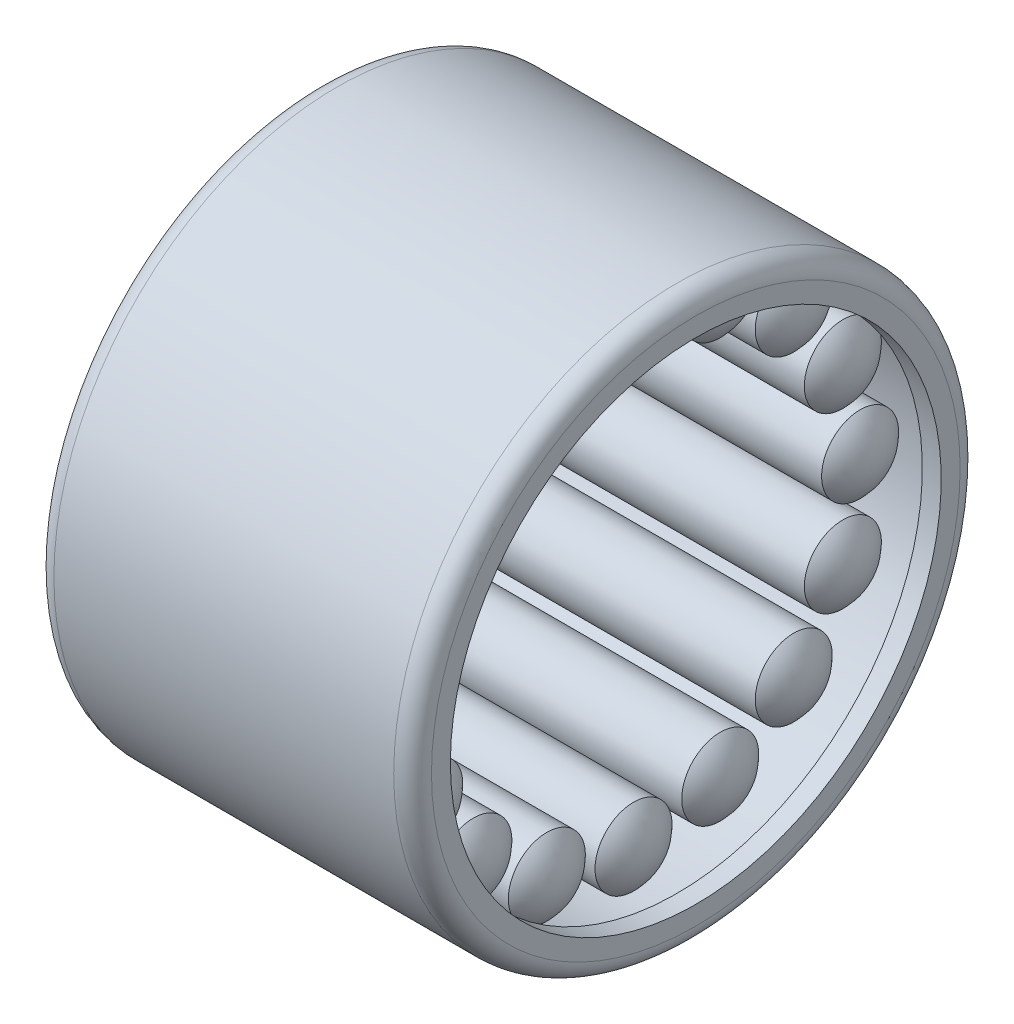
ISO-10303-21;
HEADER;
FILE_DESCRIPTION(('STEP AP214'),'2;1');
FILE_NAME('part.step','',(''),(''),'','','');
FILE_SCHEMA(('AUTOMOTIVE_DESIGN { 1 0 10303 214 1 1 1 1 }'));
ENDSEC;
DATA;
#1=APPLICATION_CONTEXT('core data for automotive mechanical design processes');
#2=APPLICATION_PROTOCOL_DEFINITION('international standard','automotive_design',2000,#1);
#3=PRODUCT_CONTEXT('',#1,'mechanical');
#4=PRODUCT('Part','Part','',(#3));
#5=PRODUCT_RELATED_PRODUCT_CATEGORY('part','',(#4));
#6=PRODUCT_DEFINITION_FORMATION('','',#4);
#7=PRODUCT_DEFINITION_CONTEXT('part definition',#1,'design');
#8=PRODUCT_DEFINITION('design','',#6,#7);
#9=PRODUCT_DEFINITION_SHAPE('','',#8);
#10=(LENGTH_UNIT() NAMED_UNIT(*) SI_UNIT(.MILLI.,.METRE.));
#11=(NAMED_UNIT(*) PLANE_ANGLE_UNIT() SI_UNIT($,.RADIAN.));
#12=(NAMED_UNIT(*) SI_UNIT($,.STERADIAN.) SOLID_ANGLE_UNIT());
#13=UNCERTAINTY_MEASURE_WITH_UNIT(LENGTH_MEASURE(1.E-05),#10,'distance_accuracy_value','');
#14=(GEOMETRIC_REPRESENTATION_CONTEXT(3) GLOBAL_UNCERTAINTY_ASSIGNED_CONTEXT((#13)) GLOBAL_UNIT_ASSIGNED_CONTEXT((#10,
#11,#12)) REPRESENTATION_CONTEXT('',''));
#15=CARTESIAN_POINT('',(0.,0.,0.));
#16=DIRECTION('',(0.,0.,1.));
#17=DIRECTION('',(1.,0.,0.));
#18=AXIS2_PLACEMENT_3D('',#15,#16,#17);
#19=CARTESIAN_POINT('',(0.,0.,0.));
#20=DIRECTION('',(-1.,0.,0.));
#21=DIRECTION('',(0.,0.,1.));
#22=AXIS2_PLACEMENT_3D('',#19,#20,#21);
#23=CYLINDRICAL_SURFACE('',#22,7.);
#24=DIRECTION('',(-1.,0.,0.));
#25=VECTOR('',#24,1.);
#26=CARTESIAN_POINT('',(4.58578643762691,4.79387094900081,-5.10086280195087));
#27=LINE('',#26,#25);
#28=CARTESIAN_POINT('',(1.02040824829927,4.7938709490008,-5.10086280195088));
#29=VERTEX_POINT('',#28);
#30=CARTESIAN_POINT('',(8.15116462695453,4.79387094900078,-5.1008628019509));
#31=VERTEX_POINT('',#30);
#32=EDGE_CURVE('E244',#29,#31,#27,.F.);
#33=ORIENTED_EDGE('',*,*,#32,.F.);
#34=CARTESIAN_POINT('',(1.02060824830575,5.1015820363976,-4.7931055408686));
#35=CARTESIAN_POINT('',(1.01371577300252,5.07687179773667,-4.81941105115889));
#36=CARTESIAN_POINT('',(1.00854814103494,5.05172935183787,-4.8457590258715));
#37=CARTESIAN_POINT('',(1.0017058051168,5.00103729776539,-4.89805352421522));
#38=CARTESIAN_POINT('',(0.999999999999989,4.97549341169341,-4.92400152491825));
#39=CARTESIAN_POINT('',(0.999999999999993,4.92400152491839,-4.97549341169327));
#40=CARTESIAN_POINT('',(1.00170580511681,4.89805352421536,-5.00103729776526));
#41=CARTESIAN_POINT('',(1.00854814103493,4.84575902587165,-5.05172935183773));
#42=CARTESIAN_POINT('',(1.01371577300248,4.81941105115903,-5.07687179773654));
#43=CARTESIAN_POINT('',(1.02060824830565,4.79310554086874,-5.10158203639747));
#44=B_SPLINE_CURVE_WITH_KNOTS('',3,(#34,#35,#36,#37,#38,#39,#40,#41,#42,#43),.UNSPECIFIED.,.F.,
.F.,(4,2,2,2,4),(0.,0.110184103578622,0.219373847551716,0.328563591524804,0.438747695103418),.UNSPECIFIED.);
#45=CARTESIAN_POINT('',(1.02040824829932,5.10086280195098,-4.79387094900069));
#46=VERTEX_POINT('',#45);
#47=EDGE_CURVE('E1223',#46,#29,#44,.T.);
#48=ORIENTED_EDGE('',*,*,#47,.F.);
#49=DIRECTION('',(-1.,0.,0.));
#50=VECTOR('',#49,1.);
#51=CARTESIAN_POINT('',(4.58578643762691,5.10086280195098,-4.79387094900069));
#52=LINE('',#51,#50);
#53=CARTESIAN_POINT('',(8.1511646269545,5.10086280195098,-4.79387094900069));
#54=VERTEX_POINT('',#53);
#55=EDGE_CURVE('E566',#54,#46,#52,.T.);
#56=ORIENTED_EDGE('',*,*,#55,.F.);
#57=CARTESIAN_POINT('',(8.15096462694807,4.79310554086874,-5.10158203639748));
#58=CARTESIAN_POINT('',(8.15785710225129,4.81941105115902,-5.07687179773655));
#59=CARTESIAN_POINT('',(8.16302473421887,4.84575902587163,-5.05172935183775));
#60=CARTESIAN_POINT('',(8.16986707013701,4.89805352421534,-5.00103729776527));
#61=CARTESIAN_POINT('',(8.17157287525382,4.92400152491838,-4.97549341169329));
#62=CARTESIAN_POINT('',(8.17157287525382,4.97549341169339,-4.92400152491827));
#63=CARTESIAN_POINT('',(8.169867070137,5.00103729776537,-4.89805352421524));
#64=CARTESIAN_POINT('',(8.16302473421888,5.05172935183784,-4.84575902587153));
#65=CARTESIAN_POINT('',(8.15785710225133,5.07687179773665,-4.81941105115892));
#66=CARTESIAN_POINT('',(8.15096462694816,5.10158203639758,-4.79310554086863));
#67=B_SPLINE_CURVE_WITH_KNOTS('',3,(#57,#58,#59,#60,#61,#62,#63,#64,#65,#66),.UNSPECIFIED.,.F.,
.F.,(4,2,2,2,4),(0.,0.110184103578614,0.219373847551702,0.328563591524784,0.438747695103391),.UNSPECIFIED.);
#68=EDGE_CURVE('E1228',#31,#54,#67,.T.);
#69=ORIENTED_EDGE('',*,*,#68,.F.);
#70=EDGE_LOOP('',(#33,#48,#56,#69));
#71=FACE_BOUND('',#70,.T.);
#72=DIRECTION('',(-1.,0.,0.));
#73=VECTOR('',#72,1.);
#74=CARTESIAN_POINT('',(4.58578643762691,-0.217076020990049,-6.99663333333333));
#75=LINE('',#74,#73);
#76=CARTESIAN_POINT('',(1.02040824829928,-0.217076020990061,-6.99663333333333));
#77=VERTEX_POINT('',#76);
#78=CARTESIAN_POINT('',(8.15116462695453,-0.217076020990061,-6.99663333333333));
#79=VERTEX_POINT('',#78);
#80=EDGE_CURVE('E502',#77,#79,#75,.F.);
#81=ORIENTED_EDGE('',*,*,#80,.F.);
#82=CARTESIAN_POINT('',(1.02060824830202,0.218125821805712,-6.99660068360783));
#83=CARTESIAN_POINT('',(1.01371577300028,0.182052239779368,-6.99772871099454));
#84=CARTESIAN_POINT('',(1.00854814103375,0.145643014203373,-6.99858114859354));
#85=CARTESIAN_POINT('',(1.00170580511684,0.0728205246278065,-6.999714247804));
#86=CARTESIAN_POINT('',(1.00000000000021,0.0364102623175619,-6.99999999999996));
#87=CARTESIAN_POINT('',(0.999999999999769,-0.0364102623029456,-7.00000000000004));
#88=CARTESIAN_POINT('',(1.00170580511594,-0.0728205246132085,-6.99971424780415));
#89=CARTESIAN_POINT('',(1.00854814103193,-0.14564301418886,-6.99858114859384));
#90=CARTESIAN_POINT('',(1.01371577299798,-0.182052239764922,-6.99772871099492));
#91=CARTESIAN_POINT('',(1.02060824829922,-0.218125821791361,-6.99660068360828));
#92=B_SPLINE_CURVE_WITH_KNOTS('',3,(#82,#83,#84,#85,#86,#87,#88,#89,#90,#91),.UNSPECIFIED.,.F.,
.F.,(4,2,2,2,4),(0.,0.110184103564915,0.21937384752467,0.328563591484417,0.438747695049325),.UNSPECIFIED.);
#93=CARTESIAN_POINT('',(1.02040824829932,0.217076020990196,-6.99663333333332));
#94=VERTEX_POINT('',#93);
#95=EDGE_CURVE('E575',#94,#77,#92,.T.);
#96=ORIENTED_EDGE('',*,*,#95,.F.);
#97=DIRECTION('',(-1.,0.,0.));
#98=VECTOR('',#97,1.);
#99=CARTESIAN_POINT('',(4.58578643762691,0.217076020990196,-6.99663333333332));
#100=LINE('',#99,#98);
#101=CARTESIAN_POINT('',(8.1511646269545,0.217076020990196,-6.99663333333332));
#102=VERTEX_POINT('',#101);
#103=EDGE_CURVE('E614',#102,#94,#100,.T.);
#104=ORIENTED_EDGE('',*,*,#103,.F.);
#105=CARTESIAN_POINT('',(8.1509646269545,-0.218125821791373,-6.99660068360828));
#106=CARTESIAN_POINT('',(8.15785710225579,-0.182052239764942,-6.99772871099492));
#107=CARTESIAN_POINT('',(8.16302473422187,-0.145643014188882,-6.99858114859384));
#108=CARTESIAN_POINT('',(8.16986707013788,-0.0728205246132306,-6.99971424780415));
#109=CARTESIAN_POINT('',(8.17157287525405,-0.0364102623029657,-7.00000000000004));
#110=CARTESIAN_POINT('',(8.17157287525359,0.0364102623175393,-6.99999999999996));
#111=CARTESIAN_POINT('',(8.16986707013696,0.0728205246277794,-6.999714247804));
#112=CARTESIAN_POINT('',(8.16302473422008,0.145643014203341,-6.99858114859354));
#113=CARTESIAN_POINT('',(8.15785710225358,0.182052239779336,-6.99772871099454));
#114=CARTESIAN_POINT('',(8.15096462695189,0.218125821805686,-6.99660068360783));
#115=B_SPLINE_CURVE_WITH_KNOTS('',3,(#105,#106,#107,#108,#109,#110,#111,#112,#113,#114),
.UNSPECIFIED.,.F.,.F.,(4,2,2,2,4),(0.,0.110184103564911,0.219373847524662,0.328563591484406,
0.43874769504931),.UNSPECIFIED.);
#116=EDGE_CURVE('E608',#79,#102,#115,.T.);
#117=ORIENTED_EDGE('',*,*,#116,.F.);
#118=EDGE_LOOP('',(#81,#96,#104,#117));
#119=FACE_BOUND('',#118,.T.);
#120=DIRECTION('',(-1.,0.,0.));
#121=VECTOR('',#120,1.);
#122=CARTESIAN_POINT('',(4.58578643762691,-5.10086280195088,-4.79387094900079));
#123=LINE('',#122,#121);
#124=CARTESIAN_POINT('',(1.02040824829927,-5.10086280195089,-4.79387094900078));
#125=VERTEX_POINT('',#124);
#126=CARTESIAN_POINT('',(8.15116462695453,-5.10086280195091,-4.79387094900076));
#127=VERTEX_POINT('',#126);
#128=EDGE_CURVE('E506',#125,#127,#123,.F.);
#129=ORIENTED_EDGE('',*,*,#128,.F.);
#130=CARTESIAN_POINT('',(1.02060824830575,-4.79310554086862,-5.10158203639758));
#131=CARTESIAN_POINT('',(1.01371577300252,-4.81941105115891,-5.07687179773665));
#132=CARTESIAN_POINT('',(1.00854814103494,-4.84575902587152,-5.05172935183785));
#133=CARTESIAN_POINT('',(1.0017058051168,-4.89805352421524,-5.00103729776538));
#134=CARTESIAN_POINT('',(0.99999999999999,-4.92400152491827,-4.97549341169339));
#135=CARTESIAN_POINT('',(0.999999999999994,-4.97549341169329,-4.92400152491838));
#136=CARTESIAN_POINT('',(1.00170580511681,-5.00103729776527,-4.89805352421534));
#137=CARTESIAN_POINT('',(1.00854814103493,-5.05172935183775,-4.84575902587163));
#138=CARTESIAN_POINT('',(1.01371577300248,-5.07687179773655,-4.81941105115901));
#139=CARTESIAN_POINT('',(1.02060824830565,-5.10158203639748,-4.79310554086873));
#140=B_SPLINE_CURVE_WITH_KNOTS('',3,(#130,#131,#132,#133,#134,#135,#136,#137,#138,#139),
.UNSPECIFIED.,.F.,.F.,(4,2,2,2,4),(0.,0.110184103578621,0.219373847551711,0.328563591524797,
0.43874769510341),.UNSPECIFIED.);
#141=CARTESIAN_POINT('',(1.02040824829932,-4.79387094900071,-5.10086280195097));
#142=VERTEX_POINT('',#141);
#143=EDGE_CURVE('E666',#142,#125,#140,.T.);
#144=ORIENTED_EDGE('',*,*,#143,.F.);
#145=DIRECTION('',(-1.,0.,0.));
#146=VECTOR('',#145,1.);
#147=CARTESIAN_POINT('',(4.58578643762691,-4.7938709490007,-5.10086280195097));
#148=LINE('',#147,#146);
#149=CARTESIAN_POINT('',(8.1511646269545,-4.7938709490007,-5.10086280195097));
#150=VERTEX_POINT('',#149);
#151=EDGE_CURVE('E667',#150,#142,#148,.T.);
#152=ORIENTED_EDGE('',*,*,#151,.F.);
#153=CARTESIAN_POINT('',(8.15096462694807,-5.10158203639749,-4.79310554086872));
#154=CARTESIAN_POINT('',(8.15785710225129,-5.07687179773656,-4.819411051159));
#155=CARTESIAN_POINT('',(8.16302473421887,-5.05172935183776,-4.84575902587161));
#156=CARTESIAN_POINT('',(8.16986707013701,-5.00103729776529,-4.89805352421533));
#157=CARTESIAN_POINT('',(8.17157287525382,-4.9754934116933,-4.92400152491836));
#158=CARTESIAN_POINT('',(8.17157287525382,-4.92400152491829,-4.97549341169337));
#159=CARTESIAN_POINT('',(8.169867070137,-4.89805352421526,-5.00103729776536));
#160=CARTESIAN_POINT('',(8.16302473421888,-4.84575902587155,-5.05172935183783));
#161=CARTESIAN_POINT('',(8.15785710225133,-4.81941105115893,-5.07687179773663));
#162=CARTESIAN_POINT('',(8.15096462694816,-4.79310554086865,-5.10158203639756));
#163=B_SPLINE_CURVE_WITH_KNOTS('',3,(#153,#154,#155,#156,#157,#158,#159,#160,#161,#162),
.UNSPECIFIED.,.F.,.F.,(4,2,2,2,4),(0.,0.110184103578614,0.2193738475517,0.328563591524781,
0.438747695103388),.UNSPECIFIED.);
#164=EDGE_CURVE('E659',#127,#150,#163,.T.);
#165=ORIENTED_EDGE('',*,*,#164,.F.);
#166=EDGE_LOOP('',(#129,#144,#152,#165));
#167=FACE_BOUND('',#166,.T.);
#168=DIRECTION('',(-1.,0.,0.));
#169=VECTOR('',#168,1.);
#170=CARTESIAN_POINT('',(4.58578643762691,-6.99663333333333,0.217076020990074));
#171=LINE('',#170,#169);
#172=CARTESIAN_POINT('',(1.02040824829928,-6.99663333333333,0.217076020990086));
#173=VERTEX_POINT('',#172);
#174=CARTESIAN_POINT('',(8.15116462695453,-6.99663333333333,0.217076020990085));
#175=VERTEX_POINT('',#174);
#176=EDGE_CURVE('E510',#173,#175,#171,.F.);
#177=ORIENTED_EDGE('',*,*,#176,.F.);
#178=CARTESIAN_POINT('',(1.02060824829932,-6.99660068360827,-0.218125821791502));
#179=CARTESIAN_POINT('',(1.01371577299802,-6.99772871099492,-0.18205223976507));
#180=CARTESIAN_POINT('',(1.00854814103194,-6.99858114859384,-0.145643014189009));
#181=CARTESIAN_POINT('',(1.00170580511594,-6.99971424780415,-0.0728205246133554));
#182=CARTESIAN_POINT('',(0.999999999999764,-7.00000000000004,-0.0364102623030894));
#183=CARTESIAN_POINT('',(1.00000000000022,-6.99999999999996,0.0364102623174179));
#184=CARTESIAN_POINT('',(1.00170580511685,-6.999714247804,0.072820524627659));
#185=CARTESIAN_POINT('',(1.00854814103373,-6.99858114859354,0.145643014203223));
#186=CARTESIAN_POINT('',(1.01371577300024,-6.99772871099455,0.18205223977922));
#187=CARTESIAN_POINT('',(1.02060824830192,-6.99660068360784,0.21812582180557));
#188=B_SPLINE_CURVE_WITH_KNOTS('',3,(#178,#179,#180,#181,#182,#183,#184,#185,#186,#187),
.UNSPECIFIED.,.F.,.F.,(4,2,2,2,4),(0.,0.110184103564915,0.219373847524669,0.328563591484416,
0.438747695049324),.UNSPECIFIED.);
#189=CARTESIAN_POINT('',(1.02040824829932,-6.99663333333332,-0.217076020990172));
#190=VERTEX_POINT('',#189);
#191=EDGE_CURVE('E1392',#190,#173,#188,.T.);
#192=ORIENTED_EDGE('',*,*,#191,.F.);
#193=DIRECTION('',(-1.,0.,0.));
#194=VECTOR('',#193,1.);
#195=CARTESIAN_POINT('',(4.58578643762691,-6.99663333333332,-0.217076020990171));
#196=LINE('',#195,#194);
#197=CARTESIAN_POINT('',(8.1511646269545,-6.99663333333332,-0.217076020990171));
#198=VERTEX_POINT('',#197);
#199=EDGE_CURVE('E1428',#198,#190,#196,.T.);
#200=ORIENTED_EDGE('',*,*,#199,.F.);
#201=CARTESIAN_POINT('',(8.15096462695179,-6.99660068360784,0.218125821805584));
#202=CARTESIAN_POINT('',(8.15785710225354,-6.99772871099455,0.182052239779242));
#203=CARTESIAN_POINT('',(8.16302473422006,-6.99858114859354,0.145643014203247));
#204=CARTESIAN_POINT('',(8.16986707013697,-6.999714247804,0.0728205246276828));
#205=CARTESIAN_POINT('',(8.1715728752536,-6.99999999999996,0.0364102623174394));
#206=CARTESIAN_POINT('',(8.17157287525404,-7.00000000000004,-0.036410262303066));
#207=CARTESIAN_POINT('',(8.16986707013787,-6.99971424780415,-0.0728205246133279));
#208=CARTESIAN_POINT('',(8.16302473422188,-6.99858114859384,-0.145643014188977));
#209=CARTESIAN_POINT('',(8.15785710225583,-6.99772871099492,-0.182052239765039));
#210=CARTESIAN_POINT('',(8.1509646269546,-6.99660068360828,-0.218125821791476));
#211=B_SPLINE_CURVE_WITH_KNOTS('',3,(#201,#202,#203,#204,#205,#206,#207,#208,#209,#210),
.UNSPECIFIED.,.F.,.F.,(4,2,2,2,4),(0.,0.110184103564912,0.219373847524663,0.328563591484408,
0.438747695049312),.UNSPECIFIED.);
#212=EDGE_CURVE('E1398',#175,#198,#211,.T.);
#213=ORIENTED_EDGE('',*,*,#212,.F.);
#214=EDGE_LOOP('',(#177,#192,#200,#213));
#215=FACE_BOUND('',#214,.T.);
#216=DIRECTION('',(-1.,0.,0.));
#217=VECTOR('',#216,1.);
#218=CARTESIAN_POINT('',(4.58578643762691,-4.79387094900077,5.1008628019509));
#219=LINE('',#218,#217);
#220=CARTESIAN_POINT('',(1.02040824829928,-4.79387094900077,5.10086280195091));
#221=VERTEX_POINT('',#220);
#222=CARTESIAN_POINT('',(8.15116462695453,-4.79387094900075,5.10086280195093));
#223=VERTEX_POINT('',#222);
#224=EDGE_CURVE('E514',#221,#223,#219,.F.);
#225=ORIENTED_EDGE('',*,*,#224,.F.);
#226=CARTESIAN_POINT('',(1.02060824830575,-5.10158203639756,4.79310554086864));
#227=CARTESIAN_POINT('',(1.01371577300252,-5.07687179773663,4.81941105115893));
#228=CARTESIAN_POINT('',(1.00854814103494,-5.05172935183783,4.84575902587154));
#229=CARTESIAN_POINT('',(1.0017058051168,-5.00103729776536,4.89805352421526));
#230=CARTESIAN_POINT('',(0.99999999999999,-4.97549341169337,4.92400152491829));
#231=CARTESIAN_POINT('',(0.999999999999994,-4.92400152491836,4.97549341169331));
#232=CARTESIAN_POINT('',(1.00170580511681,-4.89805352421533,5.00103729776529));
#233=CARTESIAN_POINT('',(1.00854814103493,-4.84575902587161,5.05172935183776));
#234=CARTESIAN_POINT('',(1.01371577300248,-4.819411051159,5.07687179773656));
#235=CARTESIAN_POINT('',(1.02060824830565,-4.79310554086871,5.1015820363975));
#236=B_SPLINE_CURVE_WITH_KNOTS('',3,(#226,#227,#228,#229,#230,#231,#232,#233,#234,#235),
.UNSPECIFIED.,.F.,.F.,(4,2,2,2,4),(0.,0.110184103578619,0.219373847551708,0.328563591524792,
0.438747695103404),.UNSPECIFIED.);
#237=CARTESIAN_POINT('',(1.02040824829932,-5.10086280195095,4.79387094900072));
#238=VERTEX_POINT('',#237);
#239=EDGE_CURVE('E1361',#238,#221,#236,.T.);
#240=ORIENTED_EDGE('',*,*,#239,.F.);
#241=DIRECTION('',(-1.,0.,0.));
#242=VECTOR('',#241,1.);
#243=CARTESIAN_POINT('',(4.58578643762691,-5.10086280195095,4.79387094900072));
#244=LINE('',#243,#242);
#245=CARTESIAN_POINT('',(8.1511646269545,-5.10086280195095,4.79387094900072));
#246=VERTEX_POINT('',#245);
#247=EDGE_CURVE('E1435',#246,#238,#244,.T.);
#248=ORIENTED_EDGE('',*,*,#247,.F.);
#249=CARTESIAN_POINT('',(8.15096462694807,-4.7931055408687,5.10158203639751));
#250=CARTESIAN_POINT('',(8.15785710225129,-4.81941105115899,5.07687179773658));
#251=CARTESIAN_POINT('',(8.16302473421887,-4.8457590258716,5.05172935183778));
#252=CARTESIAN_POINT('',(8.16986707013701,-4.89805352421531,5.0010372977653));
#253=CARTESIAN_POINT('',(8.17157287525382,-4.92400152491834,4.97549341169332));
#254=CARTESIAN_POINT('',(8.17157287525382,-4.97549341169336,4.92400152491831));
#255=CARTESIAN_POINT('',(8.169867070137,-5.00103729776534,4.89805352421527));
#256=CARTESIAN_POINT('',(8.16302473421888,-5.05172935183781,4.84575902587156));
#257=CARTESIAN_POINT('',(8.15785710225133,-5.07687179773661,4.81941105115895));
#258=CARTESIAN_POINT('',(8.15096462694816,-5.10158203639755,4.79310554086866));
#259=B_SPLINE_CURVE_WITH_KNOTS('',3,(#249,#250,#251,#252,#253,#254,#255,#256,#257,#258),
.UNSPECIFIED.,.F.,.F.,(4,2,2,2,4),(0.,0.110184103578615,0.219373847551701,0.328563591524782,
0.43874769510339),.UNSPECIFIED.);
#260=EDGE_CURVE('E1367',#223,#246,#259,.T.);
#261=ORIENTED_EDGE('',*,*,#260,.F.);
#262=EDGE_LOOP('',(#225,#240,#248,#261));
#263=FACE_BOUND('',#262,.T.);
#264=DIRECTION('',(-1.,0.,0.));
#265=VECTOR('',#264,1.);
#266=CARTESIAN_POINT('',(4.58578643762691,0.217076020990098,6.99663333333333));
#267=LINE('',#266,#265);
#268=CARTESIAN_POINT('',(1.02040824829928,0.21707602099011,6.99663333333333));
#269=VERTEX_POINT('',#268);
#270=CARTESIAN_POINT('',(8.15116462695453,0.21707602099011,6.99663333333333));
#271=VERTEX_POINT('',#270);
#272=EDGE_CURVE('E518',#269,#271,#267,.F.);
#273=ORIENTED_EDGE('',*,*,#272,.F.);
#274=CARTESIAN_POINT('',(1.02060824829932,-0.218125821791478,6.99660068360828));
#275=CARTESIAN_POINT('',(1.01371577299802,-0.182052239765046,6.99772871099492));
#276=CARTESIAN_POINT('',(1.00854814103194,-0.145643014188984,6.99858114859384));
#277=CARTESIAN_POINT('',(1.00170580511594,-0.0728205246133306,6.99971424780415));
#278=CARTESIAN_POINT('',(0.999999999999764,-0.0364102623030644,7.00000000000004));
#279=CARTESIAN_POINT('',(1.00000000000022,0.036410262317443,6.99999999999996));
#280=CARTESIAN_POINT('',(1.00170580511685,0.0728205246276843,6.999714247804));
#281=CARTESIAN_POINT('',(1.00854814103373,0.145643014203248,6.99858114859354));
#282=CARTESIAN_POINT('',(1.01371577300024,0.182052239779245,6.99772871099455));
#283=CARTESIAN_POINT('',(1.02060824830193,0.218125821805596,6.99660068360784));
#284=B_SPLINE_CURVE_WITH_KNOTS('',3,(#274,#275,#276,#277,#278,#279,#280,#281,#282,#283),
.UNSPECIFIED.,.F.,.F.,(4,2,2,2,4),(0.,0.110184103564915,0.219373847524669,0.328563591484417,
0.438747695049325),.UNSPECIFIED.);
#285=CARTESIAN_POINT('',(1.02040824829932,-0.217076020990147,6.99663333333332));
#286=VERTEX_POINT('',#285);
#287=EDGE_CURVE('E1330',#286,#269,#284,.T.);
#288=ORIENTED_EDGE('',*,*,#287,.F.);
#289=DIRECTION('',(-1.,0.,0.));
#290=VECTOR('',#289,1.);
#291=CARTESIAN_POINT('',(4.58578643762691,-0.217076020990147,6.99663333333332));
#292=LINE('',#291,#290);
#293=CARTESIAN_POINT('',(8.1511646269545,-0.217076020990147,6.99663333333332));
#294=VERTEX_POINT('',#293);
#295=EDGE_CURVE('E1442',#294,#286,#292,.T.);
#296=ORIENTED_EDGE('',*,*,#295,.F.);
#297=CARTESIAN_POINT('',(8.15096462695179,0.218125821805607,6.99660068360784));
#298=CARTESIAN_POINT('',(8.15785710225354,0.182052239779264,6.99772871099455));
#299=CARTESIAN_POINT('',(8.16302473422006,0.145643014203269,6.99858114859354));
#300=CARTESIAN_POINT('',(8.16986707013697,0.0728205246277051,6.999714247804));
#301=CARTESIAN_POINT('',(8.1715728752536,0.0364102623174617,6.99999999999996));
#302=CARTESIAN_POINT('',(8.17157287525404,-0.0364102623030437,7.00000000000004));
#303=CARTESIAN_POINT('',(8.16986707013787,-0.0728205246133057,6.99971424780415));
#304=CARTESIAN_POINT('',(8.16302473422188,-0.145643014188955,6.99858114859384));
#305=CARTESIAN_POINT('',(8.15785710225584,-0.182052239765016,6.99772871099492));
#306=CARTESIAN_POINT('',(8.1509646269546,-0.218125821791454,6.99660068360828));
#307=B_SPLINE_CURVE_WITH_KNOTS('',3,(#297,#298,#299,#300,#301,#302,#303,#304,#305,#306),
.UNSPECIFIED.,.F.,.F.,(4,2,2,2,4),(0.,0.110184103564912,0.219373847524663,0.328563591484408,
0.438747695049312),.UNSPECIFIED.);
#308=EDGE_CURVE('E1336',#271,#294,#307,.T.);
#309=ORIENTED_EDGE('',*,*,#308,.F.);
#310=EDGE_LOOP('',(#273,#288,#296,#309));
#311=FACE_BOUND('',#310,.T.);
#312=DIRECTION('',(-1.,0.,0.));
#313=VECTOR('',#312,1.);
#314=CARTESIAN_POINT('',(4.58578643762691,5.10086280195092,4.79387094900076));
#315=LINE('',#314,#313);
#316=CARTESIAN_POINT('',(1.02040824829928,5.10086280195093,4.79387094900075));
#317=VERTEX_POINT('',#316);
#318=CARTESIAN_POINT('',(8.15116462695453,5.10086280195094,4.79387094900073));
#319=VERTEX_POINT('',#318);
#320=EDGE_CURVE('E522',#317,#319,#315,.F.);
#321=ORIENTED_EDGE('',*,*,#320,.F.);
#322=CARTESIAN_POINT('',(1.02060824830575,4.79310554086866,5.10158203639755));
#323=CARTESIAN_POINT('',(1.01371577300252,4.81941105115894,5.07687179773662));
#324=CARTESIAN_POINT('',(1.00854814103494,4.84575902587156,5.05172935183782));
#325=CARTESIAN_POINT('',(1.0017058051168,4.89805352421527,5.00103729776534));
#326=CARTESIAN_POINT('',(0.99999999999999,4.92400152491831,4.97549341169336));
#327=CARTESIAN_POINT('',(0.999999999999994,4.97549341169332,4.92400152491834));
#328=CARTESIAN_POINT('',(1.00170580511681,5.00103729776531,4.89805352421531));
#329=CARTESIAN_POINT('',(1.00854814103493,5.05172935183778,4.84575902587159));
#330=CARTESIAN_POINT('',(1.01371577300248,5.07687179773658,4.81941105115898));
#331=CARTESIAN_POINT('',(1.02060824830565,5.10158203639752,4.79310554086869));
#332=B_SPLINE_CURVE_WITH_KNOTS('',3,(#322,#323,#324,#325,#326,#327,#328,#329,#330,#331),
.UNSPECIFIED.,.F.,.F.,(4,2,2,2,4),(0.,0.11018410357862,0.219373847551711,0.328563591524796,
0.438747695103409),.UNSPECIFIED.);
#333=CARTESIAN_POINT('',(1.02040824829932,4.79387094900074,5.10086280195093));
#334=VERTEX_POINT('',#333);
#335=EDGE_CURVE('E1299',#334,#317,#332,.T.);
#336=ORIENTED_EDGE('',*,*,#335,.F.);
#337=DIRECTION('',(-1.,0.,0.));
#338=VECTOR('',#337,1.);
#339=CARTESIAN_POINT('',(4.58578643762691,4.79387094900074,5.10086280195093));
#340=LINE('',#339,#338);
#341=CARTESIAN_POINT('',(8.1511646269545,4.79387094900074,5.10086280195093));
#342=VERTEX_POINT('',#341);
#343=EDGE_CURVE('E1449',#342,#334,#340,.T.);
#344=ORIENTED_EDGE('',*,*,#343,.F.);
#345=CARTESIAN_POINT('',(8.15096462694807,5.10158203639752,4.79310554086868));
#346=CARTESIAN_POINT('',(8.15785710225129,5.0768717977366,4.81941105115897));
#347=CARTESIAN_POINT('',(8.16302473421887,5.0517293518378,4.84575902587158));
#348=CARTESIAN_POINT('',(8.16986707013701,5.00103729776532,4.89805352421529));
#349=CARTESIAN_POINT('',(8.17157287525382,4.97549341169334,4.92400152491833));
#350=CARTESIAN_POINT('',(8.17157287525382,4.92400152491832,4.97549341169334));
#351=CARTESIAN_POINT('',(8.169867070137,4.89805352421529,5.00103729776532));
#352=CARTESIAN_POINT('',(8.16302473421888,4.84575902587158,5.0517293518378));
#353=CARTESIAN_POINT('',(8.15785710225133,4.81941105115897,5.0768717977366));
#354=CARTESIAN_POINT('',(8.15096462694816,4.79310554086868,5.10158203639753));
#355=B_SPLINE_CURVE_WITH_KNOTS('',3,(#345,#346,#347,#348,#349,#350,#351,#352,#353,#354),
.UNSPECIFIED.,.F.,.F.,(4,2,2,2,4),(0.,0.110184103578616,0.219373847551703,0.328563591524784,
0.438747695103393),.UNSPECIFIED.);
#356=EDGE_CURVE('E1305',#319,#342,#355,.T.);
#357=ORIENTED_EDGE('',*,*,#356,.F.);
#358=EDGE_LOOP('',(#321,#336,#344,#357));
#359=FACE_BOUND('',#358,.T.);
#360=DIRECTION('',(-1.,0.,0.));
#361=VECTOR('',#360,1.);
#362=CARTESIAN_POINT('',(4.58578643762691,6.99663333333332,-0.217076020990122));
#363=LINE('',#362,#361);
#364=CARTESIAN_POINT('',(1.02040824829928,6.99663333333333,-0.217076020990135));
#365=VERTEX_POINT('',#364);
#366=CARTESIAN_POINT('',(8.15116462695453,6.99663333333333,-0.217076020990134));
#367=VERTEX_POINT('',#366);
#368=EDGE_CURVE('E526',#365,#367,#363,.F.);
#369=ORIENTED_EDGE('',*,*,#368,.F.);
#370=CARTESIAN_POINT('',(1.02060824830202,6.99660068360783,0.218125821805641));
#371=CARTESIAN_POINT('',(1.01371577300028,6.99772871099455,0.182052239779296));
#372=CARTESIAN_POINT('',(1.00854814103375,6.99858114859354,0.1456430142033));
#373=CARTESIAN_POINT('',(1.00170580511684,6.999714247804,0.0728205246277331));
#374=CARTESIAN_POINT('',(1.00000000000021,6.99999999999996,0.0364102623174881));
#375=CARTESIAN_POINT('',(0.999999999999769,7.00000000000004,-0.0364102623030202));
#376=CARTESIAN_POINT('',(1.00170580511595,6.99971424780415,-0.0728205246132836));
#377=CARTESIAN_POINT('',(1.00854814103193,6.99858114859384,-0.145643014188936));
#378=CARTESIAN_POINT('',(1.01371577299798,6.99772871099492,-0.182052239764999));
#379=CARTESIAN_POINT('',(1.02060824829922,6.99660068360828,-0.218125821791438));
#380=B_SPLINE_CURVE_WITH_KNOTS('',3,(#370,#371,#372,#373,#374,#375,#376,#377,#378,#379),
.UNSPECIFIED.,.F.,.F.,(4,2,2,2,4),(0.,0.110184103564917,0.219373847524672,0.328563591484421,
0.438747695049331),.UNSPECIFIED.);
#381=CARTESIAN_POINT('',(1.02040824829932,6.99663333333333,0.217076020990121));
#382=VERTEX_POINT('',#381);
#383=EDGE_CURVE('E411',#382,#365,#380,.T.);
#384=ORIENTED_EDGE('',*,*,#383,.F.);
#385=DIRECTION('',(-1.,0.,0.));
#386=VECTOR('',#385,1.);
#387=CARTESIAN_POINT('',(4.58578643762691,6.99663333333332,0.217076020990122));
#388=LINE('',#387,#386);
#389=CARTESIAN_POINT('',(8.1511646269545,6.99663333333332,0.217076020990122));
#390=VERTEX_POINT('',#389);
#391=EDGE_CURVE('E400',#390,#382,#388,.T.);
#392=ORIENTED_EDGE('',*,*,#391,.F.);
#393=CARTESIAN_POINT('',(8.1509646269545,6.99660068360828,-0.218125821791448));
#394=CARTESIAN_POINT('',(8.15785710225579,6.99772871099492,-0.182052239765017));
#395=CARTESIAN_POINT('',(8.16302473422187,6.99858114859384,-0.145643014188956));
#396=CARTESIAN_POINT('',(8.16986707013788,6.99971424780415,-0.0728205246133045));
#397=CARTESIAN_POINT('',(8.17157287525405,7.00000000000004,-0.0364102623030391));
#398=CARTESIAN_POINT('',(8.17157287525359,6.99999999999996,0.0364102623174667));
#399=CARTESIAN_POINT('',(8.16986707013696,6.999714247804,0.0728205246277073));
#400=CARTESIAN_POINT('',(8.16302473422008,6.99858114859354,0.14564301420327));
#401=CARTESIAN_POINT('',(8.15785710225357,6.99772871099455,0.182052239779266));
#402=CARTESIAN_POINT('',(8.15096462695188,6.99660068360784,0.218125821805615));
#403=B_SPLINE_CURVE_WITH_KNOTS('',3,(#393,#394,#395,#396,#397,#398,#399,#400,#401,#402),
.UNSPECIFIED.,.F.,.F.,(4,2,2,2,4),(0.,0.110184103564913,0.219373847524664,0.32856359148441,
0.438747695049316),.UNSPECIFIED.);
#404=EDGE_CURVE('E403',#367,#390,#403,.T.);
#405=ORIENTED_EDGE('',*,*,#404,.F.);
#406=EDGE_LOOP('',(#369,#384,#392,#405));
#407=FACE_BOUND('',#406,.T.);
#408=CARTESIAN_POINT('',(9.3,0.,0.));
#409=DIRECTION('',(-1.,0.,0.));
#410=DIRECTION('',(0.,0.,1.));
#411=AXIS2_PLACEMENT_3D('',#408,#409,#410);
#412=CIRCLE('',#411,7.);
#413=CARTESIAN_POINT('',(9.3,0.,7.));
#414=VERTEX_POINT('',#413);
#415=EDGE_CURVE('E376',#414,#414,#412,.T.);
#416=ORIENTED_EDGE('',*,*,#415,.F.);
#417=EDGE_LOOP('',(#416));
#418=FACE_BOUND('',#417,.T.);
#419=CARTESIAN_POINT('',(0.299999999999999,0.,0.));
#420=DIRECTION('',(-1.,0.,0.));
#421=DIRECTION('',(0.,0.,1.));
#422=AXIS2_PLACEMENT_3D('',#419,#420,#421);
#423=CIRCLE('',#422,7.);
#424=CARTESIAN_POINT('',(0.299999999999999,0.,7.));
#425=VERTEX_POINT('',#424);
#426=EDGE_CURVE('E379',#425,#425,#423,.T.);
#427=ORIENTED_EDGE('',*,*,#426,.T.);
#428=EDGE_LOOP('',(#427));
#429=FACE_BOUND('',#428,.T.);
#430=DIRECTION('',(-1.,0.,0.));
#431=VECTOR('',#430,1.);
#432=CARTESIAN_POINT('',(4.58578643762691,6.54711772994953,2.47694356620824));
#433=LINE('',#432,#431);
#434=CARTESIAN_POINT('',(1.02040824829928,6.54711772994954,2.47694356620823));
#435=VERTEX_POINT('',#434);
#436=CARTESIAN_POINT('',(8.15116462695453,6.54711772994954,2.47694356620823));
#437=VERTEX_POINT('',#436);
#438=EDGE_CURVE('E534',#435,#437,#433,.F.);
#439=ORIENTED_EDGE('',*,*,#438,.F.);
#440=CARTESIAN_POINT('',(1.02060824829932,6.38054303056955,2.87900514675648));
#441=CARTESIAN_POINT('',(1.01371577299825,6.39538995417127,2.84610918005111));
#442=CARTESIAN_POINT('',(1.00854814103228,6.41011071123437,2.81279765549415));
#443=CARTESIAN_POINT('',(1.00170580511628,6.43902551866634,2.74595206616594));
#444=CARTESIAN_POINT('',(0.999999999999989,6.45322312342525,2.71242272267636));
#445=CARTESIAN_POINT('',(0.999999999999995,6.48109033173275,2.64514533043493));
#446=CARTESIAN_POINT('',(1.00170580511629,6.49475993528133,2.61139728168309));
#447=CARTESIAN_POINT('',(1.00854814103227,6.52158104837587,2.54368445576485));
#448=CARTESIAN_POINT('',(1.01371577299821,6.53472670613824,2.50972050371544));
#449=CARTESIAN_POINT('',(1.02060824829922,6.54748930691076,2.47596118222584));
#450=B_SPLINE_CURVE_WITH_KNOTS('',3,(#440,#441,#442,#443,#444,#445,#446,#447,#448,#449),
.UNSPECIFIED.,.F.,.F.,(4,2,2,2,4),(0.,0.110184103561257,0.219373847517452,0.328563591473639,
0.438747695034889),.UNSPECIFIED.);
#451=CARTESIAN_POINT('',(1.02040824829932,6.38097493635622,2.87804775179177));
#452=VERTEX_POINT('',#451);
#453=EDGE_CURVE('E1289',#452,#435,#450,.T.);
#454=ORIENTED_EDGE('',*,*,#453,.F.);
#455=DIRECTION('',(-1.,0.,0.));
#456=VECTOR('',#455,1.);
#457=CARTESIAN_POINT('',(4.58578643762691,6.38097493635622,2.87804775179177));
#458=LINE('',#457,#456);
#459=CARTESIAN_POINT('',(8.1511646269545,6.38097493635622,2.87804775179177));
#460=VERTEX_POINT('',#459);
#461=EDGE_CURVE('E1279',#460,#452,#458,.T.);
#462=ORIENTED_EDGE('',*,*,#461,.F.);
#463=CARTESIAN_POINT('',(8.1509646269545,6.54748930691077,2.47596118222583));
#464=CARTESIAN_POINT('',(8.15785710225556,6.53472670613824,2.50972050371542));
#465=CARTESIAN_POINT('',(8.16302473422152,6.52158104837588,2.54368445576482));
#466=CARTESIAN_POINT('',(8.16986707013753,6.49475993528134,2.61139728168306));
#467=CARTESIAN_POINT('',(8.17157287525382,6.48109033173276,2.64514533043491));
#468=CARTESIAN_POINT('',(8.17157287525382,6.45322312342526,2.71242272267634));
#469=CARTESIAN_POINT('',(8.16986707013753,6.43902551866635,2.74595206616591));
#470=CARTESIAN_POINT('',(8.16302473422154,6.41011071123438,2.81279765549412));
#471=CARTESIAN_POINT('',(8.15785710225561,6.39538995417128,2.84610918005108));
#472=CARTESIAN_POINT('',(8.1509646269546,6.38054303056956,2.87900514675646));
#473=B_SPLINE_CURVE_WITH_KNOTS('',3,(#463,#464,#465,#466,#467,#468,#469,#470,#471,#472),
.UNSPECIFIED.,.F.,.F.,(4,2,2,2,4),(0.,0.110184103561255,0.219373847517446,0.328563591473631,
0.438747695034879),.UNSPECIFIED.);
#474=EDGE_CURVE('E1281',#437,#460,#473,.T.);
#475=ORIENTED_EDGE('',*,*,#474,.F.);
#476=EDGE_LOOP('',(#439,#454,#462,#475));
#477=FACE_BOUND('',#476,.T.);
#478=DIRECTION('',(-1.,0.,0.));
#479=VECTOR('',#478,1.);
#480=CARTESIAN_POINT('',(4.58578643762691,2.87804775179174,6.38097493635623));
#481=LINE('',#480,#479);
#482=CARTESIAN_POINT('',(1.02040824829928,2.87804775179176,6.38097493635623));
#483=VERTEX_POINT('',#482);
#484=CARTESIAN_POINT('',(8.15116462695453,2.87804775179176,6.38097493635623));
#485=VERTEX_POINT('',#484);
#486=EDGE_CURVE('E538',#483,#485,#481,.F.);
#487=ORIENTED_EDGE('',*,*,#486,.F.);
#488=CARTESIAN_POINT('',(1.02060824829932,2.4759611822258,6.54748930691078));
#489=CARTESIAN_POINT('',(1.01371577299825,2.50972050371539,6.53472670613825));
#490=CARTESIAN_POINT('',(1.00854814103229,2.5436844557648,6.52158104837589));
#491=CARTESIAN_POINT('',(1.00170580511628,2.61139728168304,6.49475993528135));
#492=CARTESIAN_POINT('',(0.999999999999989,2.64514533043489,6.48109033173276));
#493=CARTESIAN_POINT('',(0.999999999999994,2.71242272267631,6.45322312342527));
#494=CARTESIAN_POINT('',(1.00170580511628,2.74595206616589,6.43902551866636));
#495=CARTESIAN_POINT('',(1.00854814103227,2.8127976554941,6.41011071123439));
#496=CARTESIAN_POINT('',(1.01371577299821,2.84610918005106,6.39538995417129));
#497=CARTESIAN_POINT('',(1.02060824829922,2.87900514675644,6.38054303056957));
#498=B_SPLINE_CURVE_WITH_KNOTS('',3,(#488,#489,#490,#491,#492,#493,#494,#495,#496,#497),
.UNSPECIFIED.,.F.,.F.,(4,2,2,2,4),(0.,0.110184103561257,0.219373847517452,0.32856359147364,
0.438747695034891),.UNSPECIFIED.);
#499=CARTESIAN_POINT('',(1.02040824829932,2.47694356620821,6.54711772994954));
#500=VERTEX_POINT('',#499);
#501=EDGE_CURVE('E1320',#500,#483,#498,.T.);
#502=ORIENTED_EDGE('',*,*,#501,.F.);
#503=DIRECTION('',(-1.,0.,0.));
#504=VECTOR('',#503,1.);
#505=CARTESIAN_POINT('',(4.58578643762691,2.47694356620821,6.54711772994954));
#506=LINE('',#505,#504);
#507=CARTESIAN_POINT('',(8.1511646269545,2.47694356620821,6.54711772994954));
#508=VERTEX_POINT('',#507);
#509=EDGE_CURVE('E1311',#508,#500,#506,.T.);
#510=ORIENTED_EDGE('',*,*,#509,.F.);
#511=CARTESIAN_POINT('',(8.1509646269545,2.87900514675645,6.38054303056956));
#512=CARTESIAN_POINT('',(8.15785710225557,2.84610918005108,6.39538995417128));
#513=CARTESIAN_POINT('',(8.16302473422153,2.81279765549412,6.41011071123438));
#514=CARTESIAN_POINT('',(8.16986707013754,2.74595206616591,6.43902551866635));
#515=CARTESIAN_POINT('',(8.17157287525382,2.71242272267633,6.45322312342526));
#516=CARTESIAN_POINT('',(8.17157287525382,2.64514533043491,6.48109033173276));
#517=CARTESIAN_POINT('',(8.16986707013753,2.61139728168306,6.49475993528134));
#518=CARTESIAN_POINT('',(8.16302473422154,2.54368445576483,6.52158104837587));
#519=CARTESIAN_POINT('',(8.15785710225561,2.50972050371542,6.53472670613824));
#520=CARTESIAN_POINT('',(8.1509646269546,2.47596118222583,6.54748930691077));
#521=B_SPLINE_CURVE_WITH_KNOTS('',3,(#511,#512,#513,#514,#515,#516,#517,#518,#519,#520),
.UNSPECIFIED.,.F.,.F.,(4,2,2,2,4),(0.,0.110184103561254,0.219373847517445,0.32856359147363,
0.438747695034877),.UNSPECIFIED.);
#522=EDGE_CURVE('E1314',#485,#508,#521,.T.);
#523=ORIENTED_EDGE('',*,*,#522,.F.);
#524=EDGE_LOOP('',(#487,#502,#510,#523));
#525=FACE_BOUND('',#524,.T.);
#526=DIRECTION('',(-1.,0.,0.));
#527=VECTOR('',#526,1.);
#528=CARTESIAN_POINT('',(4.58578643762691,-2.47694356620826,6.54711772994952));
#529=LINE('',#528,#527);
#530=CARTESIAN_POINT('',(1.02040824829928,-2.47694356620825,6.54711772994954));
#531=VERTEX_POINT('',#530);
#532=CARTESIAN_POINT('',(8.15116462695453,-2.47694356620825,6.54711772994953));
#533=VERTEX_POINT('',#532);
#534=EDGE_CURVE('E542',#531,#533,#529,.F.);
#535=ORIENTED_EDGE('',*,*,#534,.F.);
#536=CARTESIAN_POINT('',(1.02060824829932,-2.8790051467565,6.38054303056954));
#537=CARTESIAN_POINT('',(1.01371577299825,-2.84610918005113,6.39538995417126));
#538=CARTESIAN_POINT('',(1.00854814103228,-2.81279765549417,6.41011071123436));
#539=CARTESIAN_POINT('',(1.00170580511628,-2.74595206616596,6.43902551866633));
#540=CARTESIAN_POINT('',(0.999999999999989,-2.71242272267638,6.45322312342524));
#541=CARTESIAN_POINT('',(0.999999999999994,-2.64514533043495,6.48109033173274));
#542=CARTESIAN_POINT('',(1.00170580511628,-2.61139728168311,6.49475993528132));
#543=CARTESIAN_POINT('',(1.00854814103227,-2.54368445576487,6.52158104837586));
#544=CARTESIAN_POINT('',(1.01371577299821,-2.50972050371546,6.53472670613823));
#545=CARTESIAN_POINT('',(1.02060824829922,-2.47596118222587,6.54748930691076));
#546=B_SPLINE_CURVE_WITH_KNOTS('',3,(#536,#537,#538,#539,#540,#541,#542,#543,#544,#545),
.UNSPECIFIED.,.F.,.F.,(4,2,2,2,4),(0.,0.110184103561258,0.219373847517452,0.32856359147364,
0.43874769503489),.UNSPECIFIED.);
#547=CARTESIAN_POINT('',(1.02040824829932,-2.87804775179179,6.38097493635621));
#548=VERTEX_POINT('',#547);
#549=EDGE_CURVE('E1351',#548,#531,#546,.T.);
#550=ORIENTED_EDGE('',*,*,#549,.F.);
#551=DIRECTION('',(-1.,0.,0.));
#552=VECTOR('',#551,1.);
#553=CARTESIAN_POINT('',(4.58578643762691,-2.87804775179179,6.38097493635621));
#554=LINE('',#553,#552);
#555=CARTESIAN_POINT('',(8.1511646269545,-2.87804775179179,6.38097493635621));
#556=VERTEX_POINT('',#555);
#557=EDGE_CURVE('E1342',#556,#548,#554,.T.);
#558=ORIENTED_EDGE('',*,*,#557,.F.);
#559=CARTESIAN_POINT('',(8.1509646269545,-2.47596118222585,6.54748930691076));
#560=CARTESIAN_POINT('',(8.15785710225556,-2.50972050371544,6.53472670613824));
#561=CARTESIAN_POINT('',(8.16302473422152,-2.54368445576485,6.52158104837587));
#562=CARTESIAN_POINT('',(8.16986707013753,-2.61139728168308,6.49475993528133));
#563=CARTESIAN_POINT('',(8.17157287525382,-2.64514533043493,6.48109033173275));
#564=CARTESIAN_POINT('',(8.17157287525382,-2.71242272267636,6.45322312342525));
#565=CARTESIAN_POINT('',(8.16986707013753,-2.74595206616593,6.43902551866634));
#566=CARTESIAN_POINT('',(8.16302473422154,-2.81279765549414,6.41011071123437));
#567=CARTESIAN_POINT('',(8.15785710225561,-2.8461091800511,6.39538995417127));
#568=CARTESIAN_POINT('',(8.1509646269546,-2.87900514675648,6.38054303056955));
#569=B_SPLINE_CURVE_WITH_KNOTS('',3,(#559,#560,#561,#562,#563,#564,#565,#566,#567,#568),
.UNSPECIFIED.,.F.,.F.,(4,2,2,2,4),(0.,0.110184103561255,0.219373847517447,0.328563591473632,
0.43874769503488),.UNSPECIFIED.);
#570=EDGE_CURVE('E1345',#533,#556,#569,.T.);
#571=ORIENTED_EDGE('',*,*,#570,.F.);
#572=EDGE_LOOP('',(#535,#550,#558,#571));
#573=FACE_BOUND('',#572,.T.);
#574=DIRECTION('',(-1.,0.,0.));
#575=VECTOR('',#574,1.);
#576=CARTESIAN_POINT('',(4.58578643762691,-6.38097493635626,2.8780477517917));
#577=LINE('',#576,#575);
#578=CARTESIAN_POINT('',(1.02040824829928,-6.38097493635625,2.87804775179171));
#579=VERTEX_POINT('',#578);
#580=CARTESIAN_POINT('',(8.15116462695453,-6.38097493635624,2.87804775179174));
#581=VERTEX_POINT('',#580);
#582=EDGE_CURVE('E546',#579,#581,#577,.F.);
#583=ORIENTED_EDGE('',*,*,#582,.F.);
#584=CARTESIAN_POINT('',(1.02060824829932,-6.54748930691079,2.47596118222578));
#585=CARTESIAN_POINT('',(1.01371577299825,-6.53472670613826,2.50972050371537));
#586=CARTESIAN_POINT('',(1.00854814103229,-6.5215810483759,2.54368445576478));
#587=CARTESIAN_POINT('',(1.00170580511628,-6.49475993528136,2.61139728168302));
#588=CARTESIAN_POINT('',(0.99999999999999,-6.48109033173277,2.64514533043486));
#589=CARTESIAN_POINT('',(0.999999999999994,-6.45322312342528,2.71242272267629));
#590=CARTESIAN_POINT('',(1.00170580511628,-6.43902551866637,2.74595206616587));
#591=CARTESIAN_POINT('',(1.00854814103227,-6.4101107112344,2.81279765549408));
#592=CARTESIAN_POINT('',(1.01371577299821,-6.3953899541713,2.84610918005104));
#593=CARTESIAN_POINT('',(1.02060824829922,-6.38054303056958,2.87900514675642));
#594=B_SPLINE_CURVE_WITH_KNOTS('',3,(#584,#585,#586,#587,#588,#589,#590,#591,#592,#593),
.UNSPECIFIED.,.F.,.F.,(4,2,2,2,4),(0.,0.110184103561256,0.219373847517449,0.328563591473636,
0.438747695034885),.UNSPECIFIED.);
#595=CARTESIAN_POINT('',(1.02040824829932,-6.54711772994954,2.47694356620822));
#596=VERTEX_POINT('',#595);
#597=EDGE_CURVE('E1382',#596,#579,#594,.T.);
#598=ORIENTED_EDGE('',*,*,#597,.F.);
#599=DIRECTION('',(-1.,0.,0.));
#600=VECTOR('',#599,1.);
#601=CARTESIAN_POINT('',(4.58578643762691,-6.54711772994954,2.47694356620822));
#602=LINE('',#601,#600);
#603=CARTESIAN_POINT('',(8.1511646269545,-6.54711772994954,2.47694356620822));
#604=VERTEX_POINT('',#603);
#605=EDGE_CURVE('E1373',#604,#596,#602,.T.);
#606=ORIENTED_EDGE('',*,*,#605,.F.);
#607=CARTESIAN_POINT('',(8.1509646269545,-6.38054303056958,2.87900514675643));
#608=CARTESIAN_POINT('',(8.15785710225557,-6.39538995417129,2.84610918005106));
#609=CARTESIAN_POINT('',(8.16302473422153,-6.41011071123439,2.8127976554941));
#610=CARTESIAN_POINT('',(8.16986707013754,-6.43902551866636,2.74595206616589));
#611=CARTESIAN_POINT('',(8.17157287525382,-6.45322312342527,2.71242272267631));
#612=CARTESIAN_POINT('',(8.17157287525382,-6.48109033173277,2.64514533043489));
#613=CARTESIAN_POINT('',(8.16986707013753,-6.49475993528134,2.61139728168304));
#614=CARTESIAN_POINT('',(8.16302473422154,-6.52158104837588,2.54368445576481));
#615=CARTESIAN_POINT('',(8.15785710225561,-6.53472670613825,2.5097205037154));
#616=CARTESIAN_POINT('',(8.1509646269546,-6.54748930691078,2.47596118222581));
#617=B_SPLINE_CURVE_WITH_KNOTS('',3,(#607,#608,#609,#610,#611,#612,#613,#614,#615,#616),
.UNSPECIFIED.,.F.,.F.,(4,2,2,2,4),(0.,0.110184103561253,0.219373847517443,0.328563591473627,
0.438747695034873),.UNSPECIFIED.);
#618=EDGE_CURVE('E1376',#581,#604,#617,.T.);
#619=ORIENTED_EDGE('',*,*,#618,.F.);
#620=EDGE_LOOP('',(#583,#598,#606,#619));
#621=FACE_BOUND('',#620,.T.);
#622=DIRECTION('',(-1.,0.,0.));
#623=VECTOR('',#622,1.);
#624=CARTESIAN_POINT('',(4.58578643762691,-6.54711772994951,-2.47694356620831));
#625=LINE('',#624,#623);
#626=CARTESIAN_POINT('',(1.02040824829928,-6.54711772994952,-2.4769435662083));
#627=VERTEX_POINT('',#626);
#628=CARTESIAN_POINT('',(8.15116462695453,-6.54711772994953,-2.47694356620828));
#629=VERTEX_POINT('',#628);
#630=EDGE_CURVE('E550',#627,#629,#625,.F.);
#631=ORIENTED_EDGE('',*,*,#630,.F.);
#632=CARTESIAN_POINT('',(1.02060824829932,-6.38054303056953,-2.87900514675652));
#633=CARTESIAN_POINT('',(1.01371577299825,-6.39538995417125,-2.84610918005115));
#634=CARTESIAN_POINT('',(1.00854814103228,-6.41011071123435,-2.81279765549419));
#635=CARTESIAN_POINT('',(1.00170580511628,-6.43902551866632,-2.74595206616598));
#636=CARTESIAN_POINT('',(0.99999999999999,-6.45322312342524,-2.7124227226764));
#637=CARTESIAN_POINT('',(0.999999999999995,-6.48109033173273,-2.64514533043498));
#638=CARTESIAN_POINT('',(1.00170580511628,-6.49475993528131,-2.61139728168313));
#639=CARTESIAN_POINT('',(1.00854814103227,-6.52158104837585,-2.54368445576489));
#640=CARTESIAN_POINT('',(1.01371577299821,-6.53472670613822,-2.50972050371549));
#641=CARTESIAN_POINT('',(1.02060824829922,-6.54748930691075,-2.47596118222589));
#642=B_SPLINE_CURVE_WITH_KNOTS('',3,(#632,#633,#634,#635,#636,#637,#638,#639,#640,#641),
.UNSPECIFIED.,.F.,.F.,(4,2,2,2,4),(0.,0.110184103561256,0.219373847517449,0.328563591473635,
0.438747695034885),.UNSPECIFIED.);
#643=CARTESIAN_POINT('',(1.02040824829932,-6.38097493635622,-2.87804775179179));
#644=VERTEX_POINT('',#643);
#645=EDGE_CURVE('E1413',#644,#627,#642,.T.);
#646=ORIENTED_EDGE('',*,*,#645,.F.);
#647=DIRECTION('',(-1.,0.,0.));
#648=VECTOR('',#647,1.);
#649=CARTESIAN_POINT('',(4.58578643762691,-6.38097493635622,-2.87804775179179));
#650=LINE('',#649,#648);
#651=CARTESIAN_POINT('',(8.1511646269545,-6.38097493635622,-2.87804775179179));
#652=VERTEX_POINT('',#651);
#653=EDGE_CURVE('E1404',#652,#644,#650,.T.);
#654=ORIENTED_EDGE('',*,*,#653,.F.);
#655=CARTESIAN_POINT('',(8.1509646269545,-6.54748930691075,-2.47596118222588));
#656=CARTESIAN_POINT('',(8.15785710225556,-6.53472670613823,-2.50972050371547));
#657=CARTESIAN_POINT('',(8.16302473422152,-6.52158104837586,-2.54368445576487));
#658=CARTESIAN_POINT('',(8.16986707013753,-6.49475993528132,-2.61139728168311));
#659=CARTESIAN_POINT('',(8.17157287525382,-6.48109033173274,-2.64514533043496));
#660=CARTESIAN_POINT('',(8.17157287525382,-6.45322312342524,-2.71242272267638));
#661=CARTESIAN_POINT('',(8.16986707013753,-6.43902551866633,-2.74595206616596));
#662=CARTESIAN_POINT('',(8.16302473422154,-6.41011071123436,-2.81279765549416));
#663=CARTESIAN_POINT('',(8.15785710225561,-6.39538995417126,-2.84610918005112));
#664=CARTESIAN_POINT('',(8.1509646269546,-6.38054303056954,-2.8790051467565));
#665=B_SPLINE_CURVE_WITH_KNOTS('',3,(#655,#656,#657,#658,#659,#660,#661,#662,#663,#664),
.UNSPECIFIED.,.F.,.F.,(4,2,2,2,4),(0.,0.110184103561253,0.219373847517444,0.328563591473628,
0.438747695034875),.UNSPECIFIED.);
#666=EDGE_CURVE('E1407',#629,#652,#665,.T.);
#667=ORIENTED_EDGE('',*,*,#666,.F.);
#668=EDGE_LOOP('',(#631,#646,#654,#667));
#669=FACE_BOUND('',#668,.T.);
#670=DIRECTION('',(-1.,0.,0.));
#671=VECTOR('',#670,1.);
#672=CARTESIAN_POINT('',(4.58578643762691,-2.8780477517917,-6.38097493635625));
#673=LINE('',#672,#671);
#674=CARTESIAN_POINT('',(1.02040824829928,-2.87804775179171,-6.38097493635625));
#675=VERTEX_POINT('',#674);
#676=CARTESIAN_POINT('',(8.15116462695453,-2.87804775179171,-6.38097493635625));
#677=VERTEX_POINT('',#676);
#678=EDGE_CURVE('E554',#675,#677,#673,.F.);
#679=ORIENTED_EDGE('',*,*,#678,.F.);
#680=CARTESIAN_POINT('',(1.02060824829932,-2.47596118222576,-6.5474893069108));
#681=CARTESIAN_POINT('',(1.01371577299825,-2.50972050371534,-6.53472670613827));
#682=CARTESIAN_POINT('',(1.00854814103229,-2.54368445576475,-6.52158104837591));
#683=CARTESIAN_POINT('',(1.00170580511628,-2.61139728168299,-6.49475993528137));
#684=CARTESIAN_POINT('',(0.999999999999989,-2.64514533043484,-6.48109033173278));
#685=CARTESIAN_POINT('',(0.999999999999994,-2.71242272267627,-6.45322312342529));
#686=CARTESIAN_POINT('',(1.00170580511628,-2.74595206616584,-6.43902551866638));
#687=CARTESIAN_POINT('',(1.00854814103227,-2.81279765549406,-6.41011071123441));
#688=CARTESIAN_POINT('',(1.01371577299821,-2.84610918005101,-6.39538995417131));
#689=CARTESIAN_POINT('',(1.02060824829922,-2.87900514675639,-6.38054303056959));
#690=B_SPLINE_CURVE_WITH_KNOTS('',3,(#680,#681,#682,#683,#684,#685,#686,#687,#688,#689),
.UNSPECIFIED.,.F.,.F.,(4,2,2,2,4),(0.,0.110184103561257,0.219373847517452,0.32856359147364,
0.43874769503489),.UNSPECIFIED.);
#691=CARTESIAN_POINT('',(1.02040824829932,-2.47694356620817,-6.54711772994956));
#692=VERTEX_POINT('',#691);
#693=EDGE_CURVE('E623',#692,#675,#690,.T.);
#694=ORIENTED_EDGE('',*,*,#693,.F.);
#695=DIRECTION('',(-1.,0.,0.));
#696=VECTOR('',#695,1.);
#697=CARTESIAN_POINT('',(4.58578643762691,-2.47694356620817,-6.54711772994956));
#698=LINE('',#697,#696);
#699=CARTESIAN_POINT('',(8.1511646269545,-2.47694356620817,-6.54711772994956));
#700=VERTEX_POINT('',#699);
#701=EDGE_CURVE('E673',#700,#692,#698,.T.);
#702=ORIENTED_EDGE('',*,*,#701,.F.);
#703=CARTESIAN_POINT('',(8.1509646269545,-2.87900514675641,-6.38054303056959));
#704=CARTESIAN_POINT('',(8.15785710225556,-2.84610918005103,-6.3953899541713));
#705=CARTESIAN_POINT('',(8.16302473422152,-2.81279765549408,-6.4101107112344));
#706=CARTESIAN_POINT('',(8.16986707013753,-2.74595206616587,-6.43902551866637));
#707=CARTESIAN_POINT('',(8.17157287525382,-2.71242272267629,-6.45322312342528));
#708=CARTESIAN_POINT('',(8.17157287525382,-2.64514533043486,-6.48109033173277));
#709=CARTESIAN_POINT('',(8.16986707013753,-2.61139728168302,-6.49475993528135));
#710=CARTESIAN_POINT('',(8.16302473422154,-2.54368445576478,-6.52158104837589));
#711=CARTESIAN_POINT('',(8.1578571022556,-2.50972050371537,-6.53472670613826));
#712=CARTESIAN_POINT('',(8.1509646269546,-2.47596118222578,-6.54748930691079));
#713=B_SPLINE_CURVE_WITH_KNOTS('',3,(#703,#704,#705,#706,#707,#708,#709,#710,#711,#712),
.UNSPECIFIED.,.F.,.F.,(4,2,2,2,4),(0.,0.110184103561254,0.219373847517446,0.328563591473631,
0.438747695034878),.UNSPECIFIED.);
#714=EDGE_CURVE('E627',#677,#700,#713,.T.);
#715=ORIENTED_EDGE('',*,*,#714,.F.);
#716=EDGE_LOOP('',(#679,#694,#702,#715));
#717=FACE_BOUND('',#716,.T.);
#718=DIRECTION('',(-1.,0.,0.));
#719=VECTOR('',#718,1.);
#720=CARTESIAN_POINT('',(4.58578643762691,2.47694356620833,-6.5471177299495));
#721=LINE('',#720,#719);
#722=CARTESIAN_POINT('',(1.02040824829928,2.47694356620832,-6.54711772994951));
#723=VERTEX_POINT('',#722);
#724=CARTESIAN_POINT('',(8.15116462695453,2.47694356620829,-6.54711772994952));
#725=VERTEX_POINT('',#724);
#726=EDGE_CURVE('E557',#723,#725,#721,.F.);
#727=ORIENTED_EDGE('',*,*,#726,.F.);
#728=CARTESIAN_POINT('',(1.02060824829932,2.87900514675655,-6.38054303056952));
#729=CARTESIAN_POINT('',(1.01371577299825,2.84610918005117,-6.39538995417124));
#730=CARTESIAN_POINT('',(1.00854814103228,2.81279765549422,-6.41011071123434));
#731=CARTESIAN_POINT('',(1.00170580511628,2.745952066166,-6.43902551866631));
#732=CARTESIAN_POINT('',(0.999999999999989,2.71242272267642,-6.45322312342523));
#733=CARTESIAN_POINT('',(0.999999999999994,2.645145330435,-6.48109033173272));
#734=CARTESIAN_POINT('',(1.00170580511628,2.61139728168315,-6.4947599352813));
#735=CARTESIAN_POINT('',(1.00854814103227,2.54368445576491,-6.52158104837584));
#736=CARTESIAN_POINT('',(1.01371577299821,2.5097205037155,-6.53472670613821));
#737=CARTESIAN_POINT('',(1.02060824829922,2.47596118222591,-6.54748930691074));
#738=B_SPLINE_CURVE_WITH_KNOTS('',3,(#728,#729,#730,#731,#732,#733,#734,#735,#736,#737),
.UNSPECIFIED.,.F.,.F.,(4,2,2,2,4),(0.,0.110184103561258,0.219373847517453,0.328563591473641,
0.438747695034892),.UNSPECIFIED.);
#739=CARTESIAN_POINT('',(1.02040824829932,2.87804775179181,-6.38097493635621));
#740=VERTEX_POINT('',#739);
#741=EDGE_CURVE('E559',#740,#723,#738,.T.);
#742=ORIENTED_EDGE('',*,*,#741,.F.);
#743=DIRECTION('',(-1.,0.,0.));
#744=VECTOR('',#743,1.);
#745=CARTESIAN_POINT('',(4.58578643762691,2.8780477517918,-6.38097493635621));
#746=LINE('',#745,#744);
#747=CARTESIAN_POINT('',(8.1511646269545,2.8780477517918,-6.38097493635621));
#748=VERTEX_POINT('',#747);
#749=EDGE_CURVE('E572',#748,#740,#746,.T.);
#750=ORIENTED_EDGE('',*,*,#749,.F.);
#751=CARTESIAN_POINT('',(8.1509646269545,2.4759611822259,-6.54748930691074));
#752=CARTESIAN_POINT('',(8.15785710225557,2.50972050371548,-6.53472670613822));
#753=CARTESIAN_POINT('',(8.16302473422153,2.54368445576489,-6.52158104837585));
#754=CARTESIAN_POINT('',(8.16986707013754,2.61139728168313,-6.49475993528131));
#755=CARTESIAN_POINT('',(8.17157287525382,2.64514533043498,-6.48109033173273));
#756=CARTESIAN_POINT('',(8.17157287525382,2.7124227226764,-6.45322312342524));
#757=CARTESIAN_POINT('',(8.16986707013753,2.74595206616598,-6.43902551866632));
#758=CARTESIAN_POINT('',(8.16302473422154,2.81279765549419,-6.41011071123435));
#759=CARTESIAN_POINT('',(8.15785710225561,2.84610918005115,-6.39538995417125));
#760=CARTESIAN_POINT('',(8.1509646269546,2.87900514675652,-6.38054303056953));
#761=B_SPLINE_CURVE_WITH_KNOTS('',3,(#751,#752,#753,#754,#755,#756,#757,#758,#759,#760),
.UNSPECIFIED.,.F.,.F.,(4,2,2,2,4),(0.,0.110184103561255,0.219373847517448,0.328563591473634,
0.438747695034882),.UNSPECIFIED.);
#762=EDGE_CURVE('E562',#725,#748,#761,.T.);
#763=ORIENTED_EDGE('',*,*,#762,.F.);
#764=EDGE_LOOP('',(#727,#742,#750,#763));
#765=FACE_BOUND('',#764,.T.);
#766=DIRECTION('',(-1.,0.,0.));
#767=VECTOR('',#766,1.);
#768=CARTESIAN_POINT('',(4.58578643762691,6.38097493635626,-2.87804775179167));
#769=LINE('',#768,#767);
#770=CARTESIAN_POINT('',(1.02040824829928,6.38097493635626,-2.87804775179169));
#771=VERTEX_POINT('',#770);
#772=CARTESIAN_POINT('',(8.15116462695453,6.38097493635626,-2.87804775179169));
#773=VERTEX_POINT('',#772);
#774=EDGE_CURVE('E11',#771,#773,#769,.F.);
#775=ORIENTED_EDGE('',*,*,#774,.F.);
#776=CARTESIAN_POINT('',(1.02060824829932,6.54748930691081,-2.47596118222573));
#777=CARTESIAN_POINT('',(1.01371577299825,6.53472670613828,-2.50972050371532));
#778=CARTESIAN_POINT('',(1.00854814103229,6.52158104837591,-2.54368445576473));
#779=CARTESIAN_POINT('',(1.00170580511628,6.49475993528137,-2.61139728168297));
#780=CARTESIAN_POINT('',(0.99999999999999,6.48109033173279,-2.64514533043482));
#781=CARTESIAN_POINT('',(0.999999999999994,6.4532231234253,-2.71242272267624));
#782=CARTESIAN_POINT('',(1.00170580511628,6.43902551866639,-2.74595206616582));
#783=CARTESIAN_POINT('',(1.00854814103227,6.41011071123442,-2.81279765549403));
#784=CARTESIAN_POINT('',(1.01371577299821,6.39538995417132,-2.84610918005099));
#785=CARTESIAN_POINT('',(1.02060824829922,6.3805430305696,-2.87900514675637));
#786=B_SPLINE_CURVE_WITH_KNOTS('',3,(#776,#777,#778,#779,#780,#781,#782,#783,#784,#785),
.UNSPECIFIED.,.F.,.F.,(4,2,2,2,4),(0.,0.110184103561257,0.219373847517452,0.32856359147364,
0.438747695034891),.UNSPECIFIED.);
#787=CARTESIAN_POINT('',(1.02040824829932,6.54711772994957,-2.47694356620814));
#788=VERTEX_POINT('',#787);
#789=EDGE_CURVE('E39',#788,#771,#786,.T.);
#790=ORIENTED_EDGE('',*,*,#789,.F.);
#791=DIRECTION('',(-1.,0.,0.));
#792=VECTOR('',#791,1.);
#793=CARTESIAN_POINT('',(4.58578643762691,6.54711772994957,-2.47694356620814));
#794=LINE('',#793,#792);
#795=CARTESIAN_POINT('',(8.1511646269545,6.54711772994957,-2.47694356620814));
#796=VERTEX_POINT('',#795);
#797=EDGE_CURVE('E234',#796,#788,#794,.T.);
#798=ORIENTED_EDGE('',*,*,#797,.F.);
#799=CARTESIAN_POINT('',(8.1509646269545,6.3805430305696,-2.87900514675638));
#800=CARTESIAN_POINT('',(8.15785710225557,6.39538995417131,-2.84610918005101));
#801=CARTESIAN_POINT('',(8.16302473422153,6.41011071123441,-2.81279765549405));
#802=CARTESIAN_POINT('',(8.16986707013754,6.43902551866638,-2.74595206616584));
#803=CARTESIAN_POINT('',(8.17157287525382,6.45322312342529,-2.71242272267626));
#804=CARTESIAN_POINT('',(8.17157287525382,6.48109033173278,-2.64514533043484));
#805=CARTESIAN_POINT('',(8.16986707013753,6.49475993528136,-2.61139728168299));
#806=CARTESIAN_POINT('',(8.16302473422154,6.5215810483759,-2.54368445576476));
#807=CARTESIAN_POINT('',(8.15785710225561,6.53472670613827,-2.50972050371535));
#808=CARTESIAN_POINT('',(8.1509646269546,6.5474893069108,-2.47596118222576));
#809=B_SPLINE_CURVE_WITH_KNOTS('',3,(#799,#800,#801,#802,#803,#804,#805,#806,#807,#808),
.UNSPECIFIED.,.F.,.F.,(4,2,2,2,4),(0.,0.110184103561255,0.219373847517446,0.328563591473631,
0.438747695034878),.UNSPECIFIED.);
#810=EDGE_CURVE('E49',#773,#796,#809,.T.);
#811=ORIENTED_EDGE('',*,*,#810,.F.);
#812=EDGE_LOOP('',(#775,#790,#798,#811));
#813=FACE_BOUND('',#812,.T.);
#814=ADVANCED_FACE('F31',(#71,#119,#167,#215,#263,#311,#359,#407,#418,#429,#477,#525,#573,#621,
#669,#717,#765,#813),#23,.F.);
#815=CARTESIAN_POINT('',(0.5,1.,0.));
#816=DIRECTION('',(-1.,0.,0.));
#817=DIRECTION('',(0.,0.,1.));
#818=AXIS2_PLACEMENT_3D('',#815,#816,#817);
#819=PLANE('',#818);
#820=CARTESIAN_POINT('',(0.5,0.,0.));
#821=DIRECTION('',(-1.,0.,0.));
#822=DIRECTION('',(0.,0.,1.));
#823=AXIS2_PLACEMENT_3D('',#820,#821,#822);
#824=CIRCLE('',#823,1.);
#825=CARTESIAN_POINT('',(0.5,0.,1.));
#826=VERTEX_POINT('',#825);
#827=EDGE_CURVE('E397',#826,#826,#824,.T.);
#828=ORIENTED_EDGE('',*,*,#827,.F.);
#829=EDGE_LOOP('',(#828));
#830=FACE_BOUND('',#829,.T.);
#831=ADVANCED_FACE('F33',(#830),#819,.F.);
#832=CARTESIAN_POINT('',(0.,0.,0.));
#833=DIRECTION('',(-1.,0.,0.));
#834=DIRECTION('',(0.,0.,1.));
#835=AXIS2_PLACEMENT_3D('',#832,#833,#834);
#836=CYLINDRICAL_SURFACE('',#835,1.);
#837=CARTESIAN_POINT('',(0.3,0.,0.));
#838=DIRECTION('',(-1.,0.,0.));
#839=DIRECTION('',(0.,0.,1.));
#840=AXIS2_PLACEMENT_3D('',#837,#838,#839);
#841=CIRCLE('',#840,1.);
#842=CARTESIAN_POINT('',(0.3,0.,1.));
#843=VERTEX_POINT('',#842);
#844=EDGE_CURVE('E394',#843,#843,#841,.T.);
#845=ORIENTED_EDGE('',*,*,#844,.F.);
#846=EDGE_LOOP('',(#845));
#847=FACE_BOUND('',#846,.T.);
#848=ORIENTED_EDGE('',*,*,#827,.T.);
#849=EDGE_LOOP('',(#848));
#850=FACE_BOUND('',#849,.T.);
#851=ADVANCED_FACE('F495',(#847,#850),#836,.T.);
#852=CARTESIAN_POINT('',(0.299999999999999,4.,0.));
#853=DIRECTION('',(-1.,0.,0.));
#854=DIRECTION('',(0.,0.,1.));
#855=AXIS2_PLACEMENT_3D('',#852,#853,#854);
#856=PLANE('',#855);
#857=CARTESIAN_POINT('',(0.299999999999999,0.,0.));
#858=DIRECTION('',(-1.,0.,0.));
#859=DIRECTION('',(0.,0.,1.));
#860=AXIS2_PLACEMENT_3D('',#857,#858,#859);
#861=CIRCLE('',#860,4.);
#862=CARTESIAN_POINT('',(0.299999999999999,0.,4.));
#863=VERTEX_POINT('',#862);
#864=EDGE_CURVE('E391',#863,#863,#861,.T.);
#865=ORIENTED_EDGE('',*,*,#864,.F.);
#866=EDGE_LOOP('',(#865));
#867=FACE_BOUND('',#866,.T.);
#868=ORIENTED_EDGE('',*,*,#844,.T.);
#869=EDGE_LOOP('',(#868));
#870=FACE_BOUND('',#869,.T.);
#871=ADVANCED_FACE('F1018',(#867,#870),#856,.F.);
#872=CARTESIAN_POINT('',(0.,0.,0.));
#873=DIRECTION('',(-1.,0.,0.));
#874=DIRECTION('',(0.,0.,1.));
#875=AXIS2_PLACEMENT_3D('',#872,#873,#874);
#876=CYLINDRICAL_SURFACE('',#875,4.);
#877=CARTESIAN_POINT('',(0.5,0.,0.));
#878=DIRECTION('',(-1.,0.,0.));
#879=DIRECTION('',(0.,0.,1.));
#880=AXIS2_PLACEMENT_3D('',#877,#878,#879);
#881=CIRCLE('',#880,4.);
#882=CARTESIAN_POINT('',(0.5,0.,4.));
#883=VERTEX_POINT('',#882);
#884=EDGE_CURVE('E388',#883,#883,#881,.T.);
#885=ORIENTED_EDGE('',*,*,#884,.F.);
#886=EDGE_LOOP('',(#885));
#887=FACE_BOUND('',#886,.T.);
#888=ORIENTED_EDGE('',*,*,#864,.T.);
#889=EDGE_LOOP('',(#888));
#890=FACE_BOUND('',#889,.T.);
#891=ADVANCED_FACE('F1008',(#887,#890),#876,.F.);
#892=CARTESIAN_POINT('',(0.499999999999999,5.50000000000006,0.));
#893=DIRECTION('',(-1.,0.,0.));
#894=DIRECTION('',(0.,0.,1.));
#895=AXIS2_PLACEMENT_3D('',#892,#893,#894);
#896=PLANE('',#895);
#897=CARTESIAN_POINT('',(0.499999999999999,0.,0.));
#898=DIRECTION('',(-1.,0.,0.));
#899=DIRECTION('',(0.,0.,1.));
#900=AXIS2_PLACEMENT_3D('',#897,#898,#899);
#901=CIRCLE('',#900,5.50000000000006);
#902=CARTESIAN_POINT('',(0.499999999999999,0.,5.50000000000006));
#903=VERTEX_POINT('',#902);
#904=EDGE_CURVE('E385',#903,#903,#901,.T.);
#905=ORIENTED_EDGE('',*,*,#904,.F.);
#906=EDGE_LOOP('',(#905));
#907=FACE_BOUND('',#906,.T.);
#908=ORIENTED_EDGE('',*,*,#884,.T.);
#909=EDGE_LOOP('',(#908));
#910=FACE_BOUND('',#909,.T.);
#911=ADVANCED_FACE('F998',(#907,#910),#896,.F.);
#912=CARTESIAN_POINT('',(0.,0.,0.));
#913=DIRECTION('',(-1.,0.,0.));
#914=DIRECTION('',(0.,0.,1.));
#915=AXIS2_PLACEMENT_3D('',#912,#913,#914);
#916=CYLINDRICAL_SURFACE('',#915,5.50000000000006);
#917=CARTESIAN_POINT('',(0.299999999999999,0.,0.));
#918=DIRECTION('',(-1.,0.,0.));
#919=DIRECTION('',(0.,0.,1.));
#920=AXIS2_PLACEMENT_3D('',#917,#918,#919);
#921=CIRCLE('',#920,5.50000000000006);
#922=CARTESIAN_POINT('',(0.299999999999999,0.,5.50000000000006));
#923=VERTEX_POINT('',#922);
#924=EDGE_CURVE('E382',#923,#923,#921,.T.);
#925=ORIENTED_EDGE('',*,*,#924,.F.);
#926=EDGE_LOOP('',(#925));
#927=FACE_BOUND('',#926,.T.);
#928=ORIENTED_EDGE('',*,*,#904,.T.);
#929=EDGE_LOOP('',(#928));
#930=FACE_BOUND('',#929,.T.);
#931=ADVANCED_FACE('F486',(#927,#930),#916,.T.);
#932=CARTESIAN_POINT('',(0.299999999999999,7.,0.));
#933=DIRECTION('',(-1.,0.,0.));
#934=DIRECTION('',(0.,0.,1.));
#935=AXIS2_PLACEMENT_3D('',#932,#933,#934);
#936=PLANE('',#935);
#937=ORIENTED_EDGE('',*,*,#426,.F.);
#938=EDGE_LOOP('',(#937));
#939=FACE_BOUND('',#938,.T.);
#940=ORIENTED_EDGE('',*,*,#924,.T.);
#941=EDGE_LOOP('',(#940));
#942=FACE_BOUND('',#941,.T.);
#943=ADVANCED_FACE('F481',(#939,#942),#936,.F.);
#944=CARTESIAN_POINT('',(9.3,6.5,0.));
#945=DIRECTION('',(1.,0.,0.));
#946=DIRECTION('',(0.,0.,-1.));
#947=AXIS2_PLACEMENT_3D('',#944,#945,#946);
#948=PLANE('',#947);
#949=CARTESIAN_POINT('',(9.3,0.,0.));
#950=DIRECTION('',(-1.,0.,0.));
#951=DIRECTION('',(0.,0.,1.));
#952=AXIS2_PLACEMENT_3D('',#949,#950,#951);
#953=CIRCLE('',#952,6.5);
#954=CARTESIAN_POINT('',(9.3,0.,6.5));
#955=VERTEX_POINT('',#954);
#956=EDGE_CURVE('E373',#955,#955,#953,.T.);
#957=ORIENTED_EDGE('',*,*,#956,.F.);
#958=EDGE_LOOP('',(#957));
#959=FACE_BOUND('',#958,.T.);
#960=ORIENTED_EDGE('',*,*,#415,.T.);
#961=EDGE_LOOP('',(#960));
#962=FACE_BOUND('',#961,.T.);
#963=ADVANCED_FACE('F478',(#959,#962),#948,.F.);
#964=CARTESIAN_POINT('',(0.,0.,0.));
#965=DIRECTION('',(-1.,0.,0.));
#966=DIRECTION('',(0.,0.,1.));
#967=AXIS2_PLACEMENT_3D('',#964,#965,#966);
#968=CYLINDRICAL_SURFACE('',#967,6.5);
#969=CARTESIAN_POINT('',(9.8,0.,0.));
#970=DIRECTION('',(-1.,0.,0.));
#971=DIRECTION('',(0.,0.,1.));
#972=AXIS2_PLACEMENT_3D('',#969,#970,#971);
#973=CIRCLE('',#972,6.5);
#974=CARTESIAN_POINT('',(9.8,0.,6.5));
#975=VERTEX_POINT('',#974);
#976=EDGE_CURVE('E370',#975,#975,#973,.T.);
#977=ORIENTED_EDGE('',*,*,#976,.F.);
#978=EDGE_LOOP('',(#977));
#979=FACE_BOUND('',#978,.T.);
#980=ORIENTED_EDGE('',*,*,#956,.T.);
#981=EDGE_LOOP('',(#980));
#982=FACE_BOUND('',#981,.T.);
#983=ADVANCED_FACE('F475',(#979,#982),#968,.F.);
#984=CARTESIAN_POINT('',(9.8,7.,0.));
#985=DIRECTION('',(-1.,0.,0.));
#986=DIRECTION('',(0.,0.,1.));
#987=AXIS2_PLACEMENT_3D('',#984,#985,#986);
#988=PLANE('',#987);
#989=CARTESIAN_POINT('',(9.8,0.,0.));
#990=DIRECTION('',(-1.,0.,0.));
#991=DIRECTION('',(0.,0.,1.));
#992=AXIS2_PLACEMENT_3D('',#989,#990,#991);
#993=CIRCLE('',#992,7.);
#994=CARTESIAN_POINT('',(9.8,0.,7.));
#995=VERTEX_POINT('',#994);
#996=EDGE_CURVE('E367',#995,#995,#993,.T.);
#997=ORIENTED_EDGE('',*,*,#996,.F.);
#998=EDGE_LOOP('',(#997));
#999=FACE_BOUND('',#998,.T.);
#1000=ORIENTED_EDGE('',*,*,#976,.T.);
#1001=EDGE_LOOP('',(#1000));
#1002=FACE_BOUND('',#1001,.T.);
#1003=ADVANCED_FACE('F471',(#999,#1002),#988,.F.);
#1004=CARTESIAN_POINT('',(9.3,0.,0.));
#1005=DIRECTION('',(-1.,0.,0.));
#1006=DIRECTION('',(0.,0.,1.));
#1007=AXIS2_PLACEMENT_3D('',#1004,#1005,#1006);
#1008=TOROIDAL_SURFACE('',#1007,7.,0.5);
#1009=CARTESIAN_POINT('',(9.3,0.,0.));
#1010=DIRECTION('',(-1.,0.,0.));
#1011=DIRECTION('',(0.,0.,1.));
#1012=AXIS2_PLACEMENT_3D('',#1009,#1010,#1011);
#1013=CIRCLE('',#1012,7.5);
#1014=CARTESIAN_POINT('',(9.3,0.,7.5));
#1015=VERTEX_POINT('',#1014);
#1016=EDGE_CURVE('E364',#1015,#1015,#1013,.T.);
#1017=ORIENTED_EDGE('',*,*,#1016,.F.);
#1018=EDGE_LOOP('',(#1017));
#1019=FACE_BOUND('',#1018,.T.);
#1020=ORIENTED_EDGE('',*,*,#996,.T.);
#1021=EDGE_LOOP('',(#1020));
#1022=FACE_BOUND('',#1021,.T.);
#1023=ADVANCED_FACE('F467',(#1019,#1022),#1008,.T.);
#1024=CARTESIAN_POINT('',(0.,0.,0.));
#1025=DIRECTION('',(-1.,0.,0.));
#1026=DIRECTION('',(0.,0.,1.));
#1027=AXIS2_PLACEMENT_3D('',#1024,#1025,#1026);
#1028=CYLINDRICAL_SURFACE('',#1027,7.5);
#1029=CARTESIAN_POINT('',(0.3,0.,0.));
#1030=DIRECTION('',(-1.,0.,0.));
#1031=DIRECTION('',(0.,0.,1.));
#1032=AXIS2_PLACEMENT_3D('',#1029,#1030,#1031);
#1033=CIRCLE('',#1032,7.5);
#1034=CARTESIAN_POINT('',(0.3,0.,7.5));
#1035=VERTEX_POINT('',#1034);
#1036=EDGE_CURVE('E361',#1035,#1035,#1033,.T.);
#1037=ORIENTED_EDGE('',*,*,#1036,.F.);
#1038=EDGE_LOOP('',(#1037));
#1039=FACE_BOUND('',#1038,.T.);
#1040=ORIENTED_EDGE('',*,*,#1016,.T.);
#1041=EDGE_LOOP('',(#1040));
#1042=FACE_BOUND('',#1041,.T.);
#1043=ADVANCED_FACE('F463',(#1039,#1042),#1028,.T.);
#1044=CARTESIAN_POINT('',(0.3,0.,0.));
#1045=DIRECTION('',(-1.,0.,0.));
#1046=DIRECTION('',(0.,0.,1.));
#1047=AXIS2_PLACEMENT_3D('',#1044,#1045,#1046);
#1048=TOROIDAL_SURFACE('',#1047,7.,0.5);
#1049=CARTESIAN_POINT('',(-0.2,0.,0.));
#1050=DIRECTION('',(-1.,0.,0.));
#1051=DIRECTION('',(0.,0.,1.));
#1052=AXIS2_PLACEMENT_3D('',#1049,#1050,#1051);
#1053=CIRCLE('',#1052,7.);
#1054=CARTESIAN_POINT('',(-0.2,0.,7.));
#1055=VERTEX_POINT('',#1054);
#1056=EDGE_CURVE('E358',#1055,#1055,#1053,.T.);
#1057=ORIENTED_EDGE('',*,*,#1056,.F.);
#1058=EDGE_LOOP('',(#1057));
#1059=FACE_BOUND('',#1058,.T.);
#1060=ORIENTED_EDGE('',*,*,#1036,.T.);
#1061=EDGE_LOOP('',(#1060));
#1062=FACE_BOUND('',#1061,.T.);
#1063=ADVANCED_FACE('F459',(#1059,#1062),#1048,.T.);
#1064=CARTESIAN_POINT('',(-0.2,5.50000000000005,0.));
#1065=DIRECTION('',(1.,0.,0.));
#1066=DIRECTION('',(0.,0.,-1.));
#1067=AXIS2_PLACEMENT_3D('',#1064,#1065,#1066);
#1068=PLANE('',#1067);
#1069=CARTESIAN_POINT('',(-0.2,0.,0.));
#1070=DIRECTION('',(-1.,0.,0.));
#1071=DIRECTION('',(0.,0.,1.));
#1072=AXIS2_PLACEMENT_3D('',#1069,#1070,#1071);
#1073=CIRCLE('',#1072,5.50000000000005);
#1074=CARTESIAN_POINT('',(-0.2,0.,5.50000000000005));
#1075=VERTEX_POINT('',#1074);
#1076=EDGE_CURVE('E355',#1075,#1075,#1073,.T.);
#1077=ORIENTED_EDGE('',*,*,#1076,.F.);
#1078=EDGE_LOOP('',(#1077));
#1079=FACE_BOUND('',#1078,.T.);
#1080=ORIENTED_EDGE('',*,*,#1056,.T.);
#1081=EDGE_LOOP('',(#1080));
#1082=FACE_BOUND('',#1081,.T.);
#1083=ADVANCED_FACE('F455',(#1079,#1082),#1068,.F.);
#1084=CARTESIAN_POINT('',(0.,0.,0.));
#1085=DIRECTION('',(-1.,0.,0.));
#1086=DIRECTION('',(0.,0.,1.));
#1087=AXIS2_PLACEMENT_3D('',#1084,#1085,#1086);
#1088=CYLINDRICAL_SURFACE('',#1087,5.50000000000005);
#1089=CARTESIAN_POINT('',(0.,0.,0.));
#1090=DIRECTION('',(-1.,0.,0.));
#1091=DIRECTION('',(0.,0.,1.));
#1092=AXIS2_PLACEMENT_3D('',#1089,#1090,#1091);
#1093=CIRCLE('',#1092,5.50000000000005);
#1094=CARTESIAN_POINT('',(0.,0.,5.50000000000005));
#1095=VERTEX_POINT('',#1094);
#1096=EDGE_CURVE('E352',#1095,#1095,#1093,.T.);
#1097=ORIENTED_EDGE('',*,*,#1096,.F.);
#1098=EDGE_LOOP('',(#1097));
#1099=FACE_BOUND('',#1098,.T.);
#1100=ORIENTED_EDGE('',*,*,#1076,.T.);
#1101=EDGE_LOOP('',(#1100));
#1102=FACE_BOUND('',#1101,.T.);
#1103=ADVANCED_FACE('F451',(#1099,#1102),#1088,.F.);
#1104=CARTESIAN_POINT('',(0.,4.,0.));
#1105=DIRECTION('',(1.,0.,0.));
#1106=DIRECTION('',(0.,0.,-1.));
#1107=AXIS2_PLACEMENT_3D('',#1104,#1105,#1106);
#1108=PLANE('',#1107);
#1109=CARTESIAN_POINT('',(0.,0.,0.));
#1110=DIRECTION('',(-1.,0.,0.));
#1111=DIRECTION('',(0.,0.,1.));
#1112=AXIS2_PLACEMENT_3D('',#1109,#1110,#1111);
#1113=CIRCLE('',#1112,4.);
#1114=CARTESIAN_POINT('',(0.,0.,4.));
#1115=VERTEX_POINT('',#1114);
#1116=EDGE_CURVE('E349',#1115,#1115,#1113,.T.);
#1117=ORIENTED_EDGE('',*,*,#1116,.F.);
#1118=EDGE_LOOP('',(#1117));
#1119=FACE_BOUND('',#1118,.T.);
#1120=ORIENTED_EDGE('',*,*,#1096,.T.);
#1121=EDGE_LOOP('',(#1120));
#1122=FACE_BOUND('',#1121,.T.);
#1123=ADVANCED_FACE('F447',(#1119,#1122),#1108,.F.);
#1124=CARTESIAN_POINT('',(0.,0.,0.));
#1125=DIRECTION('',(-1.,0.,0.));
#1126=DIRECTION('',(0.,0.,1.));
#1127=AXIS2_PLACEMENT_3D('',#1124,#1125,#1126);
#1128=CYLINDRICAL_SURFACE('',#1127,4.);
#1129=CARTESIAN_POINT('',(-0.2,0.,0.));
#1130=DIRECTION('',(-1.,0.,0.));
#1131=DIRECTION('',(0.,0.,1.));
#1132=AXIS2_PLACEMENT_3D('',#1129,#1130,#1131);
#1133=CIRCLE('',#1132,4.);
#1134=CARTESIAN_POINT('',(-0.2,0.,4.));
#1135=VERTEX_POINT('',#1134);
#1136=EDGE_CURVE('E346',#1135,#1135,#1133,.T.);
#1137=ORIENTED_EDGE('',*,*,#1136,.F.);
#1138=EDGE_LOOP('',(#1137));
#1139=FACE_BOUND('',#1138,.T.);
#1140=ORIENTED_EDGE('',*,*,#1116,.T.);
#1141=EDGE_LOOP('',(#1140));
#1142=FACE_BOUND('',#1141,.T.);
#1143=ADVANCED_FACE('F443',(#1139,#1142),#1128,.T.);
#1144=CARTESIAN_POINT('',(-0.2,1.,0.));
#1145=DIRECTION('',(1.,0.,0.));
#1146=DIRECTION('',(0.,0.,-1.));
#1147=AXIS2_PLACEMENT_3D('',#1144,#1145,#1146);
#1148=PLANE('',#1147);
#1149=CARTESIAN_POINT('',(-0.2,0.,0.));
#1150=DIRECTION('',(-1.,0.,0.));
#1151=DIRECTION('',(0.,0.,1.));
#1152=AXIS2_PLACEMENT_3D('',#1149,#1150,#1151);
#1153=CIRCLE('',#1152,1.);
#1154=CARTESIAN_POINT('',(-0.2,0.,1.));
#1155=VERTEX_POINT('',#1154);
#1156=EDGE_CURVE('E343',#1155,#1155,#1153,.T.);
#1157=ORIENTED_EDGE('',*,*,#1156,.F.);
#1158=EDGE_LOOP('',(#1157));
#1159=FACE_BOUND('',#1158,.T.);
#1160=ORIENTED_EDGE('',*,*,#1136,.T.);
#1161=EDGE_LOOP('',(#1160));
#1162=FACE_BOUND('',#1161,.T.);
#1163=ADVANCED_FACE('F439',(#1159,#1162),#1148,.F.);
#1164=CARTESIAN_POINT('',(0.,0.,0.));
#1165=DIRECTION('',(-1.,0.,0.));
#1166=DIRECTION('',(0.,0.,1.));
#1167=AXIS2_PLACEMENT_3D('',#1164,#1165,#1166);
#1168=CYLINDRICAL_SURFACE('',#1167,1.);
#1169=CARTESIAN_POINT('',(0.,0.,0.));
#1170=DIRECTION('',(-1.,0.,0.));
#1171=DIRECTION('',(0.,0.,1.));
#1172=AXIS2_PLACEMENT_3D('',#1169,#1170,#1171);
#1173=CIRCLE('',#1172,1.);
#1174=CARTESIAN_POINT('',(0.,0.,1.));
#1175=VERTEX_POINT('',#1174);
#1176=EDGE_CURVE('E340',#1175,#1175,#1173,.T.);
#1177=ORIENTED_EDGE('',*,*,#1176,.F.);
#1178=EDGE_LOOP('',(#1177));
#1179=FACE_BOUND('',#1178,.T.);
#1180=ORIENTED_EDGE('',*,*,#1156,.T.);
#1181=EDGE_LOOP('',(#1180));
#1182=FACE_BOUND('',#1181,.T.);
#1183=ADVANCED_FACE('F435',(#1179,#1182),#1168,.F.);
#1184=CARTESIAN_POINT('',(0.,0.,0.));
#1185=DIRECTION('',(1.,0.,0.));
#1186=DIRECTION('',(0.,0.,-1.));
#1187=AXIS2_PLACEMENT_3D('',#1184,#1185,#1186);
#1188=PLANE('',#1187);
#1189=ORIENTED_EDGE('',*,*,#1176,.T.);
#1190=EDGE_LOOP('',(#1189));
#1191=FACE_BOUND('',#1190,.T.);
#1192=ADVANCED_FACE('F431',(#1191),#1188,.F.);
#1193=CARTESIAN_POINT('',(2.,6.00000000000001,0.));
#1194=DIRECTION('',(-1.,0.,0.));
#1195=DIRECTION('',(0.,1.,0.));
#1196=AXIS2_PLACEMENT_3D('',#1193,#1194,#1195);
#1197=SPHERICAL_SURFACE('',#1196,1.4142135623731);
#1198=CARTESIAN_POINT('',(1.02040824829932,6.00000000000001,0.));
#1199=DIRECTION('',(-1.,0.,0.));
#1200=DIRECTION('',(0.,-1.,0.));
#1201=AXIS2_PLACEMENT_3D('',#1198,#1199,#1200);
#1202=CIRCLE('',#1201,1.01999999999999);
#1203=EDGE_CURVE('E334',#365,#382,#1202,.T.);
#1204=ORIENTED_EDGE('',*,*,#1203,.T.);
#1205=ORIENTED_EDGE('',*,*,#383,.T.);
#1206=EDGE_LOOP('',(#1204,#1205));
#1207=FACE_BOUND('',#1206,.T.);
#1208=ADVANCED_FACE('F425',(#1207),#1197,.T.);
#1209=CARTESIAN_POINT('',(7.17157287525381,6.00000000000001,0.));
#1210=DIRECTION('',(-1.,0.,0.));
#1211=DIRECTION('',(0.,-1.,0.));
#1212=AXIS2_PLACEMENT_3D('',#1209,#1210,#1211);
#1213=SPHERICAL_SURFACE('',#1212,1.4142135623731);
#1214=CARTESIAN_POINT('',(8.1511646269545,6.00000000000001,0.));
#1215=DIRECTION('',(-1.,0.,0.));
#1216=DIRECTION('',(0.,-1.,0.));
#1217=AXIS2_PLACEMENT_3D('',#1214,#1215,#1216);
#1218=CIRCLE('',#1217,1.01999999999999);
#1219=EDGE_CURVE('E337',#367,#390,#1218,.T.);
#1220=ORIENTED_EDGE('',*,*,#1219,.F.);
#1221=ORIENTED_EDGE('',*,*,#404,.T.);
#1222=EDGE_LOOP('',(#1220,#1221));
#1223=FACE_BOUND('',#1222,.T.);
#1224=ADVANCED_FACE('F420',(#1223),#1213,.T.);
#1225=CARTESIAN_POINT('',(1.,6.00000000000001,0.));
#1226=DIRECTION('',(-1.,0.,0.));
#1227=DIRECTION('',(0.,-1.,0.));
#1228=AXIS2_PLACEMENT_3D('',#1225,#1226,#1227);
#1229=CYLINDRICAL_SURFACE('',#1228,1.01999999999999);
#1230=ORIENTED_EDGE('',*,*,#1203,.F.);
#1231=ORIENTED_EDGE('',*,*,#368,.T.);
#1232=ORIENTED_EDGE('',*,*,#1219,.T.);
#1233=ORIENTED_EDGE('',*,*,#391,.T.);
#1234=EDGE_LOOP('',(#1230,#1231,#1232,#1233));
#1235=FACE_BOUND('',#1234,.T.);
#1236=ADVANCED_FACE('F424',(#1235),#1229,.T.);
#1237=CARTESIAN_POINT('',(2.,5.54327719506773,2.29610059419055));
#1238=DIRECTION('',(-1.,0.,0.));
#1239=DIRECTION('',(0.,0.923879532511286,0.382683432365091));
#1240=AXIS2_PLACEMENT_3D('',#1237,#1238,#1239);
#1241=SPHERICAL_SURFACE('',#1240,1.4142135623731);
#1242=CARTESIAN_POINT('',(1.02040824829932,5.54327719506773,2.29610059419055));
#1243=DIRECTION('',(-1.,0.,0.));
#1244=DIRECTION('',(0.,-0.923879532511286,-0.382683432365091));
#1245=AXIS2_PLACEMENT_3D('',#1242,#1243,#1244);
#1246=CIRCLE('',#1245,1.01999999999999);
#1247=EDGE_CURVE('E328',#435,#452,#1246,.T.);
#1248=ORIENTED_EDGE('',*,*,#1247,.T.);
#1249=ORIENTED_EDGE('',*,*,#453,.T.);
#1250=EDGE_LOOP('',(#1248,#1249));
#1251=FACE_BOUND('',#1250,.T.);
#1252=ADVANCED_FACE('F909',(#1251),#1241,.T.);
#1253=CARTESIAN_POINT('',(7.17157287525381,5.54327719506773,2.29610059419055));
#1254=DIRECTION('',(-1.,0.,0.));
#1255=DIRECTION('',(0.,-0.923879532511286,-0.382683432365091));
#1256=AXIS2_PLACEMENT_3D('',#1253,#1254,#1255);
#1257=SPHERICAL_SURFACE('',#1256,1.4142135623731);
#1258=CARTESIAN_POINT('',(8.1511646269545,5.54327719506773,2.29610059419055));
#1259=DIRECTION('',(-1.,0.,0.));
#1260=DIRECTION('',(0.,-0.923879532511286,-0.382683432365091));
#1261=AXIS2_PLACEMENT_3D('',#1258,#1259,#1260);
#1262=CIRCLE('',#1261,1.01999999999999);
#1263=EDGE_CURVE('E331',#437,#460,#1262,.T.);
#1264=ORIENTED_EDGE('',*,*,#1263,.F.);
#1265=ORIENTED_EDGE('',*,*,#474,.T.);
#1266=EDGE_LOOP('',(#1264,#1265));
#1267=FACE_BOUND('',#1266,.T.);
#1268=ADVANCED_FACE('F901',(#1267),#1257,.T.);
#1269=CARTESIAN_POINT('',(1.,5.54327719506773,2.29610059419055));
#1270=DIRECTION('',(-1.,0.,0.));
#1271=DIRECTION('',(0.,-0.923879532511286,-0.382683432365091));
#1272=AXIS2_PLACEMENT_3D('',#1269,#1270,#1271);
#1273=CYLINDRICAL_SURFACE('',#1272,1.01999999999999);
#1274=ORIENTED_EDGE('',*,*,#1247,.F.);
#1275=ORIENTED_EDGE('',*,*,#438,.T.);
#1276=ORIENTED_EDGE('',*,*,#1263,.T.);
#1277=ORIENTED_EDGE('',*,*,#461,.T.);
#1278=EDGE_LOOP('',(#1274,#1275,#1276,#1277));
#1279=FACE_BOUND('',#1278,.T.);
#1280=ADVANCED_FACE('F893',(#1279),#1273,.T.);
#1281=CARTESIAN_POINT('',(2.,4.24264068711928,4.2426406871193));
#1282=DIRECTION('',(-1.,0.,0.));
#1283=DIRECTION('',(0.,0.707106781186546,0.707106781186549));
#1284=AXIS2_PLACEMENT_3D('',#1281,#1282,#1283);
#1285=SPHERICAL_SURFACE('',#1284,1.4142135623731);
#1286=CARTESIAN_POINT('',(1.02040824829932,4.24264068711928,4.2426406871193));
#1287=DIRECTION('',(-1.,0.,0.));
#1288=DIRECTION('',(0.,-0.707106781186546,-0.707106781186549));
#1289=AXIS2_PLACEMENT_3D('',#1286,#1287,#1288);
#1290=CIRCLE('',#1289,1.01999999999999);
#1291=EDGE_CURVE('E322',#317,#334,#1290,.T.);
#1292=ORIENTED_EDGE('',*,*,#1291,.T.);
#1293=ORIENTED_EDGE('',*,*,#335,.T.);
#1294=EDGE_LOOP('',(#1292,#1293));
#1295=FACE_BOUND('',#1294,.T.);
#1296=ADVANCED_FACE('F885',(#1295),#1285,.T.);
#1297=CARTESIAN_POINT('',(7.17157287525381,4.24264068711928,4.2426406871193));
#1298=DIRECTION('',(-1.,0.,0.));
#1299=DIRECTION('',(0.,-0.707106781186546,-0.707106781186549));
#1300=AXIS2_PLACEMENT_3D('',#1297,#1298,#1299);
#1301=SPHERICAL_SURFACE('',#1300,1.4142135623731);
#1302=CARTESIAN_POINT('',(8.1511646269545,4.24264068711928,4.2426406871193));
#1303=DIRECTION('',(-1.,0.,0.));
#1304=DIRECTION('',(0.,-0.707106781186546,-0.707106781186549));
#1305=AXIS2_PLACEMENT_3D('',#1302,#1303,#1304);
#1306=CIRCLE('',#1305,1.01999999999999);
#1307=EDGE_CURVE('E325',#319,#342,#1306,.T.);
#1308=ORIENTED_EDGE('',*,*,#1307,.F.);
#1309=ORIENTED_EDGE('',*,*,#356,.T.);
#1310=EDGE_LOOP('',(#1308,#1309));
#1311=FACE_BOUND('',#1310,.T.);
#1312=ADVANCED_FACE('F877',(#1311),#1301,.T.);
#1313=CARTESIAN_POINT('',(1.,4.24264068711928,4.2426406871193));
#1314=DIRECTION('',(-1.,0.,0.));
#1315=DIRECTION('',(0.,-0.707106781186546,-0.707106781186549));
#1316=AXIS2_PLACEMENT_3D('',#1313,#1314,#1315);
#1317=CYLINDRICAL_SURFACE('',#1316,1.01999999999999);
#1318=ORIENTED_EDGE('',*,*,#1291,.F.);
#1319=ORIENTED_EDGE('',*,*,#320,.T.);
#1320=ORIENTED_EDGE('',*,*,#1307,.T.);
#1321=ORIENTED_EDGE('',*,*,#343,.T.);
#1322=EDGE_LOOP('',(#1318,#1319,#1320,#1321));
#1323=FACE_BOUND('',#1322,.T.);
#1324=ADVANCED_FACE('F869',(#1323),#1317,.T.);
#1325=CARTESIAN_POINT('',(2.,2.29610059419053,5.54327719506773));
#1326=DIRECTION('',(-1.,0.,0.));
#1327=DIRECTION('',(0.,0.382683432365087,0.923879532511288));
#1328=AXIS2_PLACEMENT_3D('',#1325,#1326,#1327);
#1329=SPHERICAL_SURFACE('',#1328,1.4142135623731);
#1330=CARTESIAN_POINT('',(1.02040824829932,2.29610059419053,5.54327719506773));
#1331=DIRECTION('',(-1.,0.,0.));
#1332=DIRECTION('',(0.,-0.382683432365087,-0.923879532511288));
#1333=AXIS2_PLACEMENT_3D('',#1330,#1331,#1332);
#1334=CIRCLE('',#1333,1.01999999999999);
#1335=EDGE_CURVE('E316',#483,#500,#1334,.T.);
#1336=ORIENTED_EDGE('',*,*,#1335,.T.);
#1337=ORIENTED_EDGE('',*,*,#501,.T.);
#1338=EDGE_LOOP('',(#1336,#1337));
#1339=FACE_BOUND('',#1338,.T.);
#1340=ADVANCED_FACE('F861',(#1339),#1329,.T.);
#1341=CARTESIAN_POINT('',(7.17157287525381,2.29610059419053,5.54327719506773));
#1342=DIRECTION('',(-1.,0.,0.));
#1343=DIRECTION('',(0.,-0.382683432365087,-0.923879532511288));
#1344=AXIS2_PLACEMENT_3D('',#1341,#1342,#1343);
#1345=SPHERICAL_SURFACE('',#1344,1.4142135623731);
#1346=CARTESIAN_POINT('',(8.1511646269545,2.29610059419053,5.54327719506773));
#1347=DIRECTION('',(-1.,0.,0.));
#1348=DIRECTION('',(0.,-0.382683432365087,-0.923879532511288));
#1349=AXIS2_PLACEMENT_3D('',#1346,#1347,#1348);
#1350=CIRCLE('',#1349,1.01999999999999);
#1351=EDGE_CURVE('E319',#485,#508,#1350,.T.);
#1352=ORIENTED_EDGE('',*,*,#1351,.F.);
#1353=ORIENTED_EDGE('',*,*,#522,.T.);
#1354=EDGE_LOOP('',(#1352,#1353));
#1355=FACE_BOUND('',#1354,.T.);
#1356=ADVANCED_FACE('F853',(#1355),#1345,.T.);
#1357=CARTESIAN_POINT('',(1.,2.29610059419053,5.54327719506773));
#1358=DIRECTION('',(-1.,0.,0.));
#1359=DIRECTION('',(0.,-0.382683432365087,-0.923879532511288));
#1360=AXIS2_PLACEMENT_3D('',#1357,#1358,#1359);
#1361=CYLINDRICAL_SURFACE('',#1360,1.01999999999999);
#1362=ORIENTED_EDGE('',*,*,#1335,.F.);
#1363=ORIENTED_EDGE('',*,*,#486,.T.);
#1364=ORIENTED_EDGE('',*,*,#1351,.T.);
#1365=ORIENTED_EDGE('',*,*,#509,.T.);
#1366=EDGE_LOOP('',(#1362,#1363,#1364,#1365));
#1367=FACE_BOUND('',#1366,.T.);
#1368=ADVANCED_FACE('F845',(#1367),#1361,.T.);
#1369=CARTESIAN_POINT('',(2.,0.,6.00000000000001));
#1370=DIRECTION('',(-1.,0.,0.));
#1371=DIRECTION('',(0.,0.,1.));
#1372=AXIS2_PLACEMENT_3D('',#1369,#1370,#1371);
#1373=SPHERICAL_SURFACE('',#1372,1.4142135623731);
#1374=CARTESIAN_POINT('',(1.02040824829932,0.,6.00000000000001));
#1375=DIRECTION('',(-1.,0.,0.));
#1376=DIRECTION('',(0.,0.,-1.));
#1377=AXIS2_PLACEMENT_3D('',#1374,#1375,#1376);
#1378=CIRCLE('',#1377,1.01999999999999);
#1379=EDGE_CURVE('E310',#269,#286,#1378,.T.);
#1380=ORIENTED_EDGE('',*,*,#1379,.T.);
#1381=ORIENTED_EDGE('',*,*,#287,.T.);
#1382=EDGE_LOOP('',(#1380,#1381));
#1383=FACE_BOUND('',#1382,.T.);
#1384=ADVANCED_FACE('F837',(#1383),#1373,.T.);
#1385=CARTESIAN_POINT('',(7.17157287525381,0.,6.00000000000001));
#1386=DIRECTION('',(-1.,0.,0.));
#1387=DIRECTION('',(0.,0.,-1.));
#1388=AXIS2_PLACEMENT_3D('',#1385,#1386,#1387);
#1389=SPHERICAL_SURFACE('',#1388,1.4142135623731);
#1390=CARTESIAN_POINT('',(8.1511646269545,0.,6.00000000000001));
#1391=DIRECTION('',(-1.,0.,0.));
#1392=DIRECTION('',(0.,0.,-1.));
#1393=AXIS2_PLACEMENT_3D('',#1390,#1391,#1392);
#1394=CIRCLE('',#1393,1.01999999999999);
#1395=EDGE_CURVE('E313',#271,#294,#1394,.T.);
#1396=ORIENTED_EDGE('',*,*,#1395,.F.);
#1397=ORIENTED_EDGE('',*,*,#308,.T.);
#1398=EDGE_LOOP('',(#1396,#1397));
#1399=FACE_BOUND('',#1398,.T.);
#1400=ADVANCED_FACE('F829',(#1399),#1389,.T.);
#1401=CARTESIAN_POINT('',(1.,0.,6.00000000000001));
#1402=DIRECTION('',(-1.,0.,0.));
#1403=DIRECTION('',(0.,0.,-1.));
#1404=AXIS2_PLACEMENT_3D('',#1401,#1402,#1403);
#1405=CYLINDRICAL_SURFACE('',#1404,1.01999999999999);
#1406=ORIENTED_EDGE('',*,*,#1379,.F.);
#1407=ORIENTED_EDGE('',*,*,#272,.T.);
#1408=ORIENTED_EDGE('',*,*,#1395,.T.);
#1409=ORIENTED_EDGE('',*,*,#295,.T.);
#1410=EDGE_LOOP('',(#1406,#1407,#1408,#1409));
#1411=FACE_BOUND('',#1410,.T.);
#1412=ADVANCED_FACE('F821',(#1411),#1405,.T.);
#1413=CARTESIAN_POINT('',(2.,-2.29610059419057,5.54327719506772));
#1414=DIRECTION('',(-1.,0.,0.));
#1415=DIRECTION('',(0.,-0.382683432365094,0.923879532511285));
#1416=AXIS2_PLACEMENT_3D('',#1413,#1414,#1415);
#1417=SPHERICAL_SURFACE('',#1416,1.4142135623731);
#1418=CARTESIAN_POINT('',(1.02040824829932,-2.29610059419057,5.54327719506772));
#1419=DIRECTION('',(-1.,0.,0.));
#1420=DIRECTION('',(0.,0.382683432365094,-0.923879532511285));
#1421=AXIS2_PLACEMENT_3D('',#1418,#1419,#1420);
#1422=CIRCLE('',#1421,1.01999999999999);
#1423=EDGE_CURVE('E304',#531,#548,#1422,.T.);
#1424=ORIENTED_EDGE('',*,*,#1423,.T.);
#1425=ORIENTED_EDGE('',*,*,#549,.T.);
#1426=EDGE_LOOP('',(#1424,#1425));
#1427=FACE_BOUND('',#1426,.T.);
#1428=ADVANCED_FACE('F813',(#1427),#1417,.T.);
#1429=CARTESIAN_POINT('',(7.17157287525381,-2.29610059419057,5.54327719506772));
#1430=DIRECTION('',(-1.,0.,0.));
#1431=DIRECTION('',(0.,0.382683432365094,-0.923879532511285));
#1432=AXIS2_PLACEMENT_3D('',#1429,#1430,#1431);
#1433=SPHERICAL_SURFACE('',#1432,1.4142135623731);
#1434=CARTESIAN_POINT('',(8.1511646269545,-2.29610059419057,5.54327719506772));
#1435=DIRECTION('',(-1.,0.,0.));
#1436=DIRECTION('',(0.,0.382683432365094,-0.923879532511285));
#1437=AXIS2_PLACEMENT_3D('',#1434,#1435,#1436);
#1438=CIRCLE('',#1437,1.01999999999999);
#1439=EDGE_CURVE('E307',#533,#556,#1438,.T.);
#1440=ORIENTED_EDGE('',*,*,#1439,.F.);
#1441=ORIENTED_EDGE('',*,*,#570,.T.);
#1442=EDGE_LOOP('',(#1440,#1441));
#1443=FACE_BOUND('',#1442,.T.);
#1444=ADVANCED_FACE('F805',(#1443),#1433,.T.);
#1445=CARTESIAN_POINT('',(1.,-2.29610059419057,5.54327719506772));
#1446=DIRECTION('',(-1.,0.,0.));
#1447=DIRECTION('',(0.,0.382683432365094,-0.923879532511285));
#1448=AXIS2_PLACEMENT_3D('',#1445,#1446,#1447);
#1449=CYLINDRICAL_SURFACE('',#1448,1.01999999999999);
#1450=ORIENTED_EDGE('',*,*,#1423,.F.);
#1451=ORIENTED_EDGE('',*,*,#534,.T.);
#1452=ORIENTED_EDGE('',*,*,#1439,.T.);
#1453=ORIENTED_EDGE('',*,*,#557,.T.);
#1454=EDGE_LOOP('',(#1450,#1451,#1452,#1453));
#1455=FACE_BOUND('',#1454,.T.);
#1456=ADVANCED_FACE('F797',(#1455),#1449,.T.);
#1457=CARTESIAN_POINT('',(2.,-4.24264068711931,4.24264068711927));
#1458=DIRECTION('',(-1.,0.,0.));
#1459=DIRECTION('',(0.,-0.707106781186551,0.707106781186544));
#1460=AXIS2_PLACEMENT_3D('',#1457,#1458,#1459);
#1461=SPHERICAL_SURFACE('',#1460,1.4142135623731);
#1462=CARTESIAN_POINT('',(1.02040824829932,-4.24264068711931,4.24264068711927));
#1463=DIRECTION('',(-1.,0.,0.));
#1464=DIRECTION('',(0.,0.707106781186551,-0.707106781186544));
#1465=AXIS2_PLACEMENT_3D('',#1462,#1463,#1464);
#1466=CIRCLE('',#1465,1.01999999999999);
#1467=EDGE_CURVE('E298',#221,#238,#1466,.T.);
#1468=ORIENTED_EDGE('',*,*,#1467,.T.);
#1469=ORIENTED_EDGE('',*,*,#239,.T.);
#1470=EDGE_LOOP('',(#1468,#1469));
#1471=FACE_BOUND('',#1470,.T.);
#1472=ADVANCED_FACE('F789',(#1471),#1461,.T.);
#1473=CARTESIAN_POINT('',(7.17157287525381,-4.24264068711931,4.24264068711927));
#1474=DIRECTION('',(-1.,0.,0.));
#1475=DIRECTION('',(0.,0.707106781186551,-0.707106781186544));
#1476=AXIS2_PLACEMENT_3D('',#1473,#1474,#1475);
#1477=SPHERICAL_SURFACE('',#1476,1.4142135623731);
#1478=CARTESIAN_POINT('',(8.1511646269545,-4.24264068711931,4.24264068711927));
#1479=DIRECTION('',(-1.,0.,0.));
#1480=DIRECTION('',(0.,0.707106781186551,-0.707106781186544));
#1481=AXIS2_PLACEMENT_3D('',#1478,#1479,#1480);
#1482=CIRCLE('',#1481,1.01999999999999);
#1483=EDGE_CURVE('E301',#223,#246,#1482,.T.);
#1484=ORIENTED_EDGE('',*,*,#1483,.F.);
#1485=ORIENTED_EDGE('',*,*,#260,.T.);
#1486=EDGE_LOOP('',(#1484,#1485));
#1487=FACE_BOUND('',#1486,.T.);
#1488=ADVANCED_FACE('F781',(#1487),#1477,.T.);
#1489=CARTESIAN_POINT('',(1.,-4.24264068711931,4.24264068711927));
#1490=DIRECTION('',(-1.,0.,0.));
#1491=DIRECTION('',(0.,0.707106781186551,-0.707106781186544));
#1492=AXIS2_PLACEMENT_3D('',#1489,#1490,#1491);
#1493=CYLINDRICAL_SURFACE('',#1492,1.01999999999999);
#1494=ORIENTED_EDGE('',*,*,#1467,.F.);
#1495=ORIENTED_EDGE('',*,*,#224,.T.);
#1496=ORIENTED_EDGE('',*,*,#1483,.T.);
#1497=ORIENTED_EDGE('',*,*,#247,.T.);
#1498=EDGE_LOOP('',(#1494,#1495,#1496,#1497));
#1499=FACE_BOUND('',#1498,.T.);
#1500=ADVANCED_FACE('F773',(#1499),#1493,.T.);
#1501=CARTESIAN_POINT('',(2.,-5.54327719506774,2.29610059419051));
#1502=DIRECTION('',(-1.,0.,0.));
#1503=DIRECTION('',(0.,-0.923879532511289,0.382683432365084));
#1504=AXIS2_PLACEMENT_3D('',#1501,#1502,#1503);
#1505=SPHERICAL_SURFACE('',#1504,1.4142135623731);
#1506=CARTESIAN_POINT('',(1.02040824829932,-5.54327719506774,2.29610059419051));
#1507=DIRECTION('',(-1.,0.,0.));
#1508=DIRECTION('',(0.,0.923879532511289,-0.382683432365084));
#1509=AXIS2_PLACEMENT_3D('',#1506,#1507,#1508);
#1510=CIRCLE('',#1509,1.01999999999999);
#1511=EDGE_CURVE('E292',#579,#596,#1510,.T.);
#1512=ORIENTED_EDGE('',*,*,#1511,.T.);
#1513=ORIENTED_EDGE('',*,*,#597,.T.);
#1514=EDGE_LOOP('',(#1512,#1513));
#1515=FACE_BOUND('',#1514,.T.);
#1516=ADVANCED_FACE('F765',(#1515),#1505,.T.);
#1517=CARTESIAN_POINT('',(7.17157287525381,-5.54327719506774,2.29610059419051));
#1518=DIRECTION('',(-1.,0.,0.));
#1519=DIRECTION('',(0.,0.923879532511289,-0.382683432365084));
#1520=AXIS2_PLACEMENT_3D('',#1517,#1518,#1519);
#1521=SPHERICAL_SURFACE('',#1520,1.4142135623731);
#1522=CARTESIAN_POINT('',(8.1511646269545,-5.54327719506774,2.29610059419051));
#1523=DIRECTION('',(-1.,0.,0.));
#1524=DIRECTION('',(0.,0.923879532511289,-0.382683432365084));
#1525=AXIS2_PLACEMENT_3D('',#1522,#1523,#1524);
#1526=CIRCLE('',#1525,1.01999999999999);
#1527=EDGE_CURVE('E295',#581,#604,#1526,.T.);
#1528=ORIENTED_EDGE('',*,*,#1527,.F.);
#1529=ORIENTED_EDGE('',*,*,#618,.T.);
#1530=EDGE_LOOP('',(#1528,#1529));
#1531=FACE_BOUND('',#1530,.T.);
#1532=ADVANCED_FACE('F757',(#1531),#1521,.T.);
#1533=CARTESIAN_POINT('',(1.,-5.54327719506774,2.29610059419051));
#1534=DIRECTION('',(-1.,0.,0.));
#1535=DIRECTION('',(0.,0.923879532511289,-0.382683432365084));
#1536=AXIS2_PLACEMENT_3D('',#1533,#1534,#1535);
#1537=CYLINDRICAL_SURFACE('',#1536,1.01999999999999);
#1538=ORIENTED_EDGE('',*,*,#1511,.F.);
#1539=ORIENTED_EDGE('',*,*,#582,.T.);
#1540=ORIENTED_EDGE('',*,*,#1527,.T.);
#1541=ORIENTED_EDGE('',*,*,#605,.T.);
#1542=EDGE_LOOP('',(#1538,#1539,#1540,#1541));
#1543=FACE_BOUND('',#1542,.T.);
#1544=ADVANCED_FACE('F749',(#1543),#1537,.T.);
#1545=CARTESIAN_POINT('',(2.,-6.00000000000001,0.));
#1546=DIRECTION('',(-1.,0.,0.));
#1547=DIRECTION('',(0.,-1.,0.));
#1548=AXIS2_PLACEMENT_3D('',#1545,#1546,#1547);
#1549=SPHERICAL_SURFACE('',#1548,1.4142135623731);
#1550=CARTESIAN_POINT('',(1.02040824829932,-6.00000000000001,0.));
#1551=DIRECTION('',(-1.,0.,0.));
#1552=DIRECTION('',(0.,1.,0.));
#1553=AXIS2_PLACEMENT_3D('',#1550,#1551,#1552);
#1554=CIRCLE('',#1553,1.01999999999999);
#1555=EDGE_CURVE('E286',#173,#190,#1554,.T.);
#1556=ORIENTED_EDGE('',*,*,#1555,.T.);
#1557=ORIENTED_EDGE('',*,*,#191,.T.);
#1558=EDGE_LOOP('',(#1556,#1557));
#1559=FACE_BOUND('',#1558,.T.);
#1560=ADVANCED_FACE('F741',(#1559),#1549,.T.);
#1561=CARTESIAN_POINT('',(7.17157287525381,-6.00000000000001,0.));
#1562=DIRECTION('',(-1.,0.,0.));
#1563=DIRECTION('',(0.,1.,0.));
#1564=AXIS2_PLACEMENT_3D('',#1561,#1562,#1563);
#1565=SPHERICAL_SURFACE('',#1564,1.4142135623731);
#1566=CARTESIAN_POINT('',(8.1511646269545,-6.00000000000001,0.));
#1567=DIRECTION('',(-1.,0.,0.));
#1568=DIRECTION('',(0.,1.,0.));
#1569=AXIS2_PLACEMENT_3D('',#1566,#1567,#1568);
#1570=CIRCLE('',#1569,1.01999999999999);
#1571=EDGE_CURVE('E289',#175,#198,#1570,.T.);
#1572=ORIENTED_EDGE('',*,*,#1571,.F.);
#1573=ORIENTED_EDGE('',*,*,#212,.T.);
#1574=EDGE_LOOP('',(#1572,#1573));
#1575=FACE_BOUND('',#1574,.T.);
#1576=ADVANCED_FACE('F733',(#1575),#1565,.T.);
#1577=CARTESIAN_POINT('',(1.,-6.00000000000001,0.));
#1578=DIRECTION('',(-1.,0.,0.));
#1579=DIRECTION('',(0.,1.,0.));
#1580=AXIS2_PLACEMENT_3D('',#1577,#1578,#1579);
#1581=CYLINDRICAL_SURFACE('',#1580,1.01999999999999);
#1582=ORIENTED_EDGE('',*,*,#1555,.F.);
#1583=ORIENTED_EDGE('',*,*,#176,.T.);
#1584=ORIENTED_EDGE('',*,*,#1571,.T.);
#1585=ORIENTED_EDGE('',*,*,#199,.T.);
#1586=EDGE_LOOP('',(#1582,#1583,#1584,#1585));
#1587=FACE_BOUND('',#1586,.T.);
#1588=ADVANCED_FACE('F725',(#1587),#1581,.T.);
#1589=CARTESIAN_POINT('',(2.,-5.54327719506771,-2.29610059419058));
#1590=DIRECTION('',(-1.,0.,0.));
#1591=DIRECTION('',(0.,-0.923879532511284,-0.382683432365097));
#1592=AXIS2_PLACEMENT_3D('',#1589,#1590,#1591);
#1593=SPHERICAL_SURFACE('',#1592,1.4142135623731);
#1594=CARTESIAN_POINT('',(1.02040824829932,-5.54327719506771,-2.29610059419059));
#1595=DIRECTION('',(-1.,0.,0.));
#1596=DIRECTION('',(0.,0.923879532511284,0.382683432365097));
#1597=AXIS2_PLACEMENT_3D('',#1594,#1595,#1596);
#1598=CIRCLE('',#1597,1.01999999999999);
#1599=EDGE_CURVE('E280',#627,#644,#1598,.T.);
#1600=ORIENTED_EDGE('',*,*,#1599,.T.);
#1601=ORIENTED_EDGE('',*,*,#645,.T.);
#1602=EDGE_LOOP('',(#1600,#1601));
#1603=FACE_BOUND('',#1602,.T.);
#1604=ADVANCED_FACE('F717',(#1603),#1593,.T.);
#1605=CARTESIAN_POINT('',(7.17157287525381,-5.54327719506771,-2.29610059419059));
#1606=DIRECTION('',(-1.,0.,0.));
#1607=DIRECTION('',(0.,0.923879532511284,0.382683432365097));
#1608=AXIS2_PLACEMENT_3D('',#1605,#1606,#1607);
#1609=SPHERICAL_SURFACE('',#1608,1.4142135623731);
#1610=CARTESIAN_POINT('',(8.1511646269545,-5.54327719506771,-2.29610059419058));
#1611=DIRECTION('',(-1.,0.,0.));
#1612=DIRECTION('',(0.,0.923879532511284,0.382683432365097));
#1613=AXIS2_PLACEMENT_3D('',#1610,#1611,#1612);
#1614=CIRCLE('',#1613,1.01999999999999);
#1615=EDGE_CURVE('E283',#629,#652,#1614,.T.);
#1616=ORIENTED_EDGE('',*,*,#1615,.F.);
#1617=ORIENTED_EDGE('',*,*,#666,.T.);
#1618=EDGE_LOOP('',(#1616,#1617));
#1619=FACE_BOUND('',#1618,.T.);
#1620=ADVANCED_FACE('F710',(#1619),#1609,.T.);
#1621=CARTESIAN_POINT('',(1.,-5.54327719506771,-2.29610059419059));
#1622=DIRECTION('',(-1.,0.,0.));
#1623=DIRECTION('',(0.,0.923879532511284,0.382683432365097));
#1624=AXIS2_PLACEMENT_3D('',#1621,#1622,#1623);
#1625=CYLINDRICAL_SURFACE('',#1624,1.01999999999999);
#1626=ORIENTED_EDGE('',*,*,#1599,.F.);
#1627=ORIENTED_EDGE('',*,*,#630,.T.);
#1628=ORIENTED_EDGE('',*,*,#1615,.T.);
#1629=ORIENTED_EDGE('',*,*,#653,.T.);
#1630=EDGE_LOOP('',(#1626,#1627,#1628,#1629));
#1631=FACE_BOUND('',#1630,.T.);
#1632=ADVANCED_FACE('F703',(#1631),#1625,.T.);
#1633=CARTESIAN_POINT('',(2.,-4.24264068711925,-4.24264068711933));
#1634=DIRECTION('',(-1.,0.,0.));
#1635=DIRECTION('',(0.,-0.707106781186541,-0.707106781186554));
#1636=AXIS2_PLACEMENT_3D('',#1633,#1634,#1635);
#1637=SPHERICAL_SURFACE('',#1636,1.4142135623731);
#1638=CARTESIAN_POINT('',(1.02040824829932,-4.24264068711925,-4.24264068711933));
#1639=DIRECTION('',(-1.,0.,0.));
#1640=DIRECTION('',(0.,0.707106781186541,0.707106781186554));
#1641=AXIS2_PLACEMENT_3D('',#1638,#1639,#1640);
#1642=CIRCLE('',#1641,1.01999999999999);
#1643=EDGE_CURVE('E274',#125,#142,#1642,.T.);
#1644=ORIENTED_EDGE('',*,*,#1643,.T.);
#1645=ORIENTED_EDGE('',*,*,#143,.T.);
#1646=EDGE_LOOP('',(#1644,#1645));
#1647=FACE_BOUND('',#1646,.T.);
#1648=ADVANCED_FACE('F654',(#1647),#1637,.T.);
#1649=CARTESIAN_POINT('',(7.17157287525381,-4.24264068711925,-4.24264068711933));
#1650=DIRECTION('',(-1.,0.,0.));
#1651=DIRECTION('',(0.,0.707106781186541,0.707106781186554));
#1652=AXIS2_PLACEMENT_3D('',#1649,#1650,#1651);
#1653=SPHERICAL_SURFACE('',#1652,1.4142135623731);
#1654=CARTESIAN_POINT('',(8.1511646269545,-4.24264068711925,-4.24264068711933));
#1655=DIRECTION('',(-1.,0.,0.));
#1656=DIRECTION('',(0.,0.707106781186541,0.707106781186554));
#1657=AXIS2_PLACEMENT_3D('',#1654,#1655,#1656);
#1658=CIRCLE('',#1657,1.01999999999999);
#1659=EDGE_CURVE('E277',#127,#150,#1658,.T.);
#1660=ORIENTED_EDGE('',*,*,#1659,.F.);
#1661=ORIENTED_EDGE('',*,*,#164,.T.);
#1662=EDGE_LOOP('',(#1660,#1661));
#1663=FACE_BOUND('',#1662,.T.);
#1664=ADVANCED_FACE('F649',(#1663),#1653,.T.);
#1665=CARTESIAN_POINT('',(1.,-4.24264068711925,-4.24264068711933));
#1666=DIRECTION('',(-1.,0.,0.));
#1667=DIRECTION('',(0.,0.707106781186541,0.707106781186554));
#1668=AXIS2_PLACEMENT_3D('',#1665,#1666,#1667);
#1669=CYLINDRICAL_SURFACE('',#1668,1.01999999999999);
#1670=ORIENTED_EDGE('',*,*,#1643,.F.);
#1671=ORIENTED_EDGE('',*,*,#128,.T.);
#1672=ORIENTED_EDGE('',*,*,#1659,.T.);
#1673=ORIENTED_EDGE('',*,*,#151,.T.);
#1674=EDGE_LOOP('',(#1670,#1671,#1672,#1673));
#1675=FACE_BOUND('',#1674,.T.);
#1676=ADVANCED_FACE('F644',(#1675),#1669,.T.);
#1677=CARTESIAN_POINT('',(2.,-2.29610059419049,-5.54327719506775));
#1678=DIRECTION('',(-1.,0.,0.));
#1679=DIRECTION('',(0.,-0.382683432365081,-0.923879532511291));
#1680=AXIS2_PLACEMENT_3D('',#1677,#1678,#1679);
#1681=SPHERICAL_SURFACE('',#1680,1.4142135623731);
#1682=CARTESIAN_POINT('',(1.02040824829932,-2.29610059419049,-5.54327719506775));
#1683=DIRECTION('',(-1.,0.,0.));
#1684=DIRECTION('',(0.,0.382683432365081,0.923879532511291));
#1685=AXIS2_PLACEMENT_3D('',#1682,#1683,#1684);
#1686=CIRCLE('',#1685,1.01999999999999);
#1687=EDGE_CURVE('E268',#675,#692,#1686,.T.);
#1688=ORIENTED_EDGE('',*,*,#1687,.T.);
#1689=ORIENTED_EDGE('',*,*,#693,.T.);
#1690=EDGE_LOOP('',(#1688,#1689));
#1691=FACE_BOUND('',#1690,.T.);
#1692=ADVANCED_FACE('F639',(#1691),#1681,.T.);
#1693=CARTESIAN_POINT('',(7.17157287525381,-2.29610059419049,-5.54327719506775));
#1694=DIRECTION('',(-1.,0.,0.));
#1695=DIRECTION('',(0.,0.382683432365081,0.923879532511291));
#1696=AXIS2_PLACEMENT_3D('',#1693,#1694,#1695);
#1697=SPHERICAL_SURFACE('',#1696,1.4142135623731);
#1698=CARTESIAN_POINT('',(8.1511646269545,-2.29610059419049,-5.54327719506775));
#1699=DIRECTION('',(-1.,0.,0.));
#1700=DIRECTION('',(0.,0.382683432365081,0.923879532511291));
#1701=AXIS2_PLACEMENT_3D('',#1698,#1699,#1700);
#1702=CIRCLE('',#1701,1.01999999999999);
#1703=EDGE_CURVE('E271',#677,#700,#1702,.T.);
#1704=ORIENTED_EDGE('',*,*,#1703,.F.);
#1705=ORIENTED_EDGE('',*,*,#714,.T.);
#1706=EDGE_LOOP('',(#1704,#1705));
#1707=FACE_BOUND('',#1706,.T.);
#1708=ADVANCED_FACE('F643',(#1707),#1697,.T.);
#1709=CARTESIAN_POINT('',(1.,-2.29610059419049,-5.54327719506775));
#1710=DIRECTION('',(-1.,0.,0.));
#1711=DIRECTION('',(0.,0.382683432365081,0.923879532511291));
#1712=AXIS2_PLACEMENT_3D('',#1709,#1710,#1711);
#1713=CYLINDRICAL_SURFACE('',#1712,1.01999999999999);
#1714=ORIENTED_EDGE('',*,*,#1687,.F.);
#1715=ORIENTED_EDGE('',*,*,#678,.T.);
#1716=ORIENTED_EDGE('',*,*,#1703,.T.);
#1717=ORIENTED_EDGE('',*,*,#701,.T.);
#1718=EDGE_LOOP('',(#1714,#1715,#1716,#1717));
#1719=FACE_BOUND('',#1718,.T.);
#1720=ADVANCED_FACE('F677',(#1719),#1713,.T.);
#1721=CARTESIAN_POINT('',(2.,0.,-6.00000000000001));
#1722=DIRECTION('',(-1.,0.,0.));
#1723=DIRECTION('',(0.,0.,-1.));
#1724=AXIS2_PLACEMENT_3D('',#1721,#1722,#1723);
#1725=SPHERICAL_SURFACE('',#1724,1.4142135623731);
#1726=CARTESIAN_POINT('',(1.02040824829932,0.,-6.00000000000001));
#1727=DIRECTION('',(-1.,0.,0.));
#1728=DIRECTION('',(0.,0.,1.));
#1729=AXIS2_PLACEMENT_3D('',#1726,#1727,#1728);
#1730=CIRCLE('',#1729,1.01999999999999);
#1731=EDGE_CURVE('E262',#77,#94,#1730,.T.);
#1732=ORIENTED_EDGE('',*,*,#1731,.T.);
#1733=ORIENTED_EDGE('',*,*,#95,.T.);
#1734=EDGE_LOOP('',(#1732,#1733));
#1735=FACE_BOUND('',#1734,.T.);
#1736=ADVANCED_FACE('F603',(#1735),#1725,.T.);
#1737=CARTESIAN_POINT('',(7.17157287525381,0.,-6.00000000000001));
#1738=DIRECTION('',(-1.,0.,0.));
#1739=DIRECTION('',(0.,0.,1.));
#1740=AXIS2_PLACEMENT_3D('',#1737,#1738,#1739);
#1741=SPHERICAL_SURFACE('',#1740,1.4142135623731);
#1742=CARTESIAN_POINT('',(8.1511646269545,0.,-6.00000000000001));
#1743=DIRECTION('',(-1.,0.,0.));
#1744=DIRECTION('',(0.,0.,1.));
#1745=AXIS2_PLACEMENT_3D('',#1742,#1743,#1744);
#1746=CIRCLE('',#1745,1.01999999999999);
#1747=EDGE_CURVE('E265',#79,#102,#1746,.T.);
#1748=ORIENTED_EDGE('',*,*,#1747,.F.);
#1749=ORIENTED_EDGE('',*,*,#116,.T.);
#1750=EDGE_LOOP('',(#1748,#1749));
#1751=FACE_BOUND('',#1750,.T.);
#1752=ADVANCED_FACE('F598',(#1751),#1741,.T.);
#1753=CARTESIAN_POINT('',(1.,0.,-6.00000000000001));
#1754=DIRECTION('',(-1.,0.,0.));
#1755=DIRECTION('',(0.,0.,1.));
#1756=AXIS2_PLACEMENT_3D('',#1753,#1754,#1755);
#1757=CYLINDRICAL_SURFACE('',#1756,1.01999999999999);
#1758=ORIENTED_EDGE('',*,*,#1731,.F.);
#1759=ORIENTED_EDGE('',*,*,#80,.T.);
#1760=ORIENTED_EDGE('',*,*,#1747,.T.);
#1761=ORIENTED_EDGE('',*,*,#103,.T.);
#1762=EDGE_LOOP('',(#1758,#1759,#1760,#1761));
#1763=FACE_BOUND('',#1762,.T.);
#1764=ADVANCED_FACE('F595',(#1763),#1757,.T.);
#1765=CARTESIAN_POINT('',(2.,2.2961005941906,-5.5432771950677));
#1766=DIRECTION('',(-1.,0.,0.));
#1767=DIRECTION('',(0.,0.3826834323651,-0.923879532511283));
#1768=AXIS2_PLACEMENT_3D('',#1765,#1766,#1767);
#1769=SPHERICAL_SURFACE('',#1768,1.4142135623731);
#1770=CARTESIAN_POINT('',(1.02040824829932,2.2961005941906,-5.5432771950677));
#1771=DIRECTION('',(-1.,0.,0.));
#1772=DIRECTION('',(0.,-0.3826834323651,0.923879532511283));
#1773=AXIS2_PLACEMENT_3D('',#1770,#1771,#1772);
#1774=CIRCLE('',#1773,1.01999999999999);
#1775=EDGE_CURVE('E256',#723,#740,#1774,.T.);
#1776=ORIENTED_EDGE('',*,*,#1775,.T.);
#1777=ORIENTED_EDGE('',*,*,#741,.T.);
#1778=EDGE_LOOP('',(#1776,#1777));
#1779=FACE_BOUND('',#1778,.T.);
#1780=ADVANCED_FACE('F569',(#1779),#1769,.T.);
#1781=CARTESIAN_POINT('',(7.17157287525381,2.2961005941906,-5.5432771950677));
#1782=DIRECTION('',(-1.,0.,0.));
#1783=DIRECTION('',(0.,-0.3826834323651,0.923879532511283));
#1784=AXIS2_PLACEMENT_3D('',#1781,#1782,#1783);
#1785=SPHERICAL_SURFACE('',#1784,1.4142135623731);
#1786=CARTESIAN_POINT('',(8.1511646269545,2.2961005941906,-5.5432771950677));
#1787=DIRECTION('',(-1.,0.,0.));
#1788=DIRECTION('',(0.,-0.3826834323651,0.923879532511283));
#1789=AXIS2_PLACEMENT_3D('',#1786,#1787,#1788);
#1790=CIRCLE('',#1789,1.01999999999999);
#1791=EDGE_CURVE('E259',#725,#748,#1790,.T.);
#1792=ORIENTED_EDGE('',*,*,#1791,.F.);
#1793=ORIENTED_EDGE('',*,*,#762,.T.);
#1794=EDGE_LOOP('',(#1792,#1793));
#1795=FACE_BOUND('',#1794,.T.);
#1796=ADVANCED_FACE('F586',(#1795),#1785,.T.);
#1797=CARTESIAN_POINT('',(1.,2.2961005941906,-5.5432771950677));
#1798=DIRECTION('',(-1.,0.,0.));
#1799=DIRECTION('',(0.,-0.3826834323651,0.923879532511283));
#1800=AXIS2_PLACEMENT_3D('',#1797,#1798,#1799);
#1801=CYLINDRICAL_SURFACE('',#1800,1.01999999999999);
#1802=ORIENTED_EDGE('',*,*,#1775,.F.);
#1803=ORIENTED_EDGE('',*,*,#726,.T.);
#1804=ORIENTED_EDGE('',*,*,#1791,.T.);
#1805=ORIENTED_EDGE('',*,*,#749,.T.);
#1806=EDGE_LOOP('',(#1802,#1803,#1804,#1805));
#1807=FACE_BOUND('',#1806,.T.);
#1808=ADVANCED_FACE('F571',(#1807),#1801,.T.);
#1809=CARTESIAN_POINT('',(2.,4.24264068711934,-4.24264068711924));
#1810=DIRECTION('',(-1.,0.,0.));
#1811=DIRECTION('',(0.,0.707106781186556,-0.707106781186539));
#1812=AXIS2_PLACEMENT_3D('',#1809,#1810,#1811);
#1813=SPHERICAL_SURFACE('',#1812,1.4142135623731);
#1814=CARTESIAN_POINT('',(1.02040824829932,4.24264068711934,-4.24264068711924));
#1815=DIRECTION('',(-1.,0.,0.));
#1816=DIRECTION('',(0.,-0.707106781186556,0.707106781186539));
#1817=AXIS2_PLACEMENT_3D('',#1814,#1815,#1816);
#1818=CIRCLE('',#1817,1.01999999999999);
#1819=EDGE_CURVE('E248',#29,#46,#1818,.T.);
#1820=ORIENTED_EDGE('',*,*,#1819,.T.);
#1821=ORIENTED_EDGE('',*,*,#47,.T.);
#1822=EDGE_LOOP('',(#1820,#1821));
#1823=FACE_BOUND('',#1822,.T.);
#1824=ADVANCED_FACE('F1151',(#1823),#1813,.T.);
#1825=CARTESIAN_POINT('',(7.17157287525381,4.24264068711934,-4.24264068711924));
#1826=DIRECTION('',(-1.,0.,0.));
#1827=DIRECTION('',(0.,-0.707106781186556,0.707106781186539));
#1828=AXIS2_PLACEMENT_3D('',#1825,#1826,#1827);
#1829=SPHERICAL_SURFACE('',#1828,1.4142135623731);
#1830=CARTESIAN_POINT('',(8.1511646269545,4.24264068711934,-4.24264068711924));
#1831=DIRECTION('',(-1.,0.,0.));
#1832=DIRECTION('',(0.,-0.707106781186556,0.707106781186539));
#1833=AXIS2_PLACEMENT_3D('',#1830,#1831,#1832);
#1834=CIRCLE('',#1833,1.01999999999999);
#1835=EDGE_CURVE('E253',#31,#54,#1834,.T.);
#1836=ORIENTED_EDGE('',*,*,#1835,.F.);
#1837=ORIENTED_EDGE('',*,*,#68,.T.);
#1838=EDGE_LOOP('',(#1836,#1837));
#1839=FACE_BOUND('',#1838,.T.);
#1840=ADVANCED_FACE('F1158',(#1839),#1829,.T.);
#1841=CARTESIAN_POINT('',(1.,4.24264068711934,-4.24264068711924));
#1842=DIRECTION('',(-1.,0.,0.));
#1843=DIRECTION('',(0.,-0.707106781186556,0.707106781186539));
#1844=AXIS2_PLACEMENT_3D('',#1841,#1842,#1843);
#1845=CYLINDRICAL_SURFACE('',#1844,1.01999999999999);
#1846=ORIENTED_EDGE('',*,*,#1819,.F.);
#1847=ORIENTED_EDGE('',*,*,#32,.T.);
#1848=ORIENTED_EDGE('',*,*,#1835,.T.);
#1849=ORIENTED_EDGE('',*,*,#55,.T.);
#1850=EDGE_LOOP('',(#1846,#1847,#1848,#1849));
#1851=FACE_BOUND('',#1850,.T.);
#1852=ADVANCED_FACE('F1166',(#1851),#1845,.T.);
#1853=CARTESIAN_POINT('',(2.,5.54327719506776,-2.29610059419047));
#1854=DIRECTION('',(-1.,0.,0.));
#1855=DIRECTION('',(0.,0.923879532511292,-0.382683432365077));
#1856=AXIS2_PLACEMENT_3D('',#1853,#1854,#1855);
#1857=SPHERICAL_SURFACE('',#1856,1.4142135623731);
#1858=CARTESIAN_POINT('',(1.02040824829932,5.54327719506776,-2.29610059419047));
#1859=DIRECTION('',(-1.,0.,0.));
#1860=DIRECTION('',(0.,-0.923879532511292,0.382683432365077));
#1861=AXIS2_PLACEMENT_3D('',#1858,#1859,#1860);
#1862=CIRCLE('',#1861,1.01999999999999);
#1863=EDGE_CURVE('E241',#771,#788,#1862,.T.);
#1864=ORIENTED_EDGE('',*,*,#1863,.T.);
#1865=ORIENTED_EDGE('',*,*,#789,.T.);
#1866=EDGE_LOOP('',(#1864,#1865));
#1867=FACE_BOUND('',#1866,.T.);
#1868=ADVANCED_FACE('F246',(#1867),#1857,.T.);
#1869=CARTESIAN_POINT('',(7.17157287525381,5.54327719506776,-2.29610059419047));
#1870=DIRECTION('',(-1.,0.,0.));
#1871=DIRECTION('',(0.,-0.923879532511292,0.382683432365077));
#1872=AXIS2_PLACEMENT_3D('',#1869,#1870,#1871);
#1873=SPHERICAL_SURFACE('',#1872,1.4142135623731);
#1874=CARTESIAN_POINT('',(8.1511646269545,5.54327719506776,-2.29610059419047));
#1875=DIRECTION('',(-1.,0.,0.));
#1876=DIRECTION('',(0.,-0.923879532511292,0.382683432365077));
#1877=AXIS2_PLACEMENT_3D('',#1874,#1875,#1876);
#1878=CIRCLE('',#1877,1.01999999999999);
#1879=EDGE_CURVE('E243',#773,#796,#1878,.T.);
#1880=ORIENTED_EDGE('',*,*,#1879,.F.);
#1881=ORIENTED_EDGE('',*,*,#810,.T.);
#1882=EDGE_LOOP('',(#1880,#1881));
#1883=FACE_BOUND('',#1882,.T.);
#1884=ADVANCED_FACE('F1183',(#1883),#1873,.T.);
#1885=CARTESIAN_POINT('',(1.,5.54327719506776,-2.29610059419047));
#1886=DIRECTION('',(-1.,0.,0.));
#1887=DIRECTION('',(0.,-0.923879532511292,0.382683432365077));
#1888=AXIS2_PLACEMENT_3D('',#1885,#1886,#1887);
#1889=CYLINDRICAL_SURFACE('',#1888,1.01999999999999);
#1890=ORIENTED_EDGE('',*,*,#1863,.F.);
#1891=ORIENTED_EDGE('',*,*,#774,.T.);
#1892=ORIENTED_EDGE('',*,*,#1879,.T.);
#1893=ORIENTED_EDGE('',*,*,#797,.T.);
#1894=EDGE_LOOP('',(#1890,#1891,#1892,#1893));
#1895=FACE_BOUND('',#1894,.T.);
#1896=ADVANCED_FACE('F240',(#1895),#1889,.T.);
#1897=CLOSED_SHELL('',(#814,#831,#851,#871,#891,#911,#931,#943,#963,#983,#1003,#1023,#1043,
#1063,#1083,#1103,#1123,#1143,#1163,#1183,#1192,#1208,#1224,#1236,#1252,#1268,#1280,#1296,#1312,
#1324,#1340,#1356,#1368,#1384,#1400,#1412,#1428,#1444,#1456,#1472,#1488,#1500,#1516,#1532,#1544,
#1560,#1576,#1588,#1604,#1620,#1632,#1648,#1664,#1676,#1692,#1708,#1720,#1736,#1752,#1764,#1780,
#1796,#1808,#1824,#1840,#1852,#1868,#1884,#1896));
#1898=MANIFOLD_SOLID_BREP('B2',#1897);
#1899=ADVANCED_BREP_SHAPE_REPRESENTATION('',(#18,#1898),#14);
#1900=SHAPE_DEFINITION_REPRESENTATION(#9,#1899);
ENDSEC;
END-ISO-10303-21;
